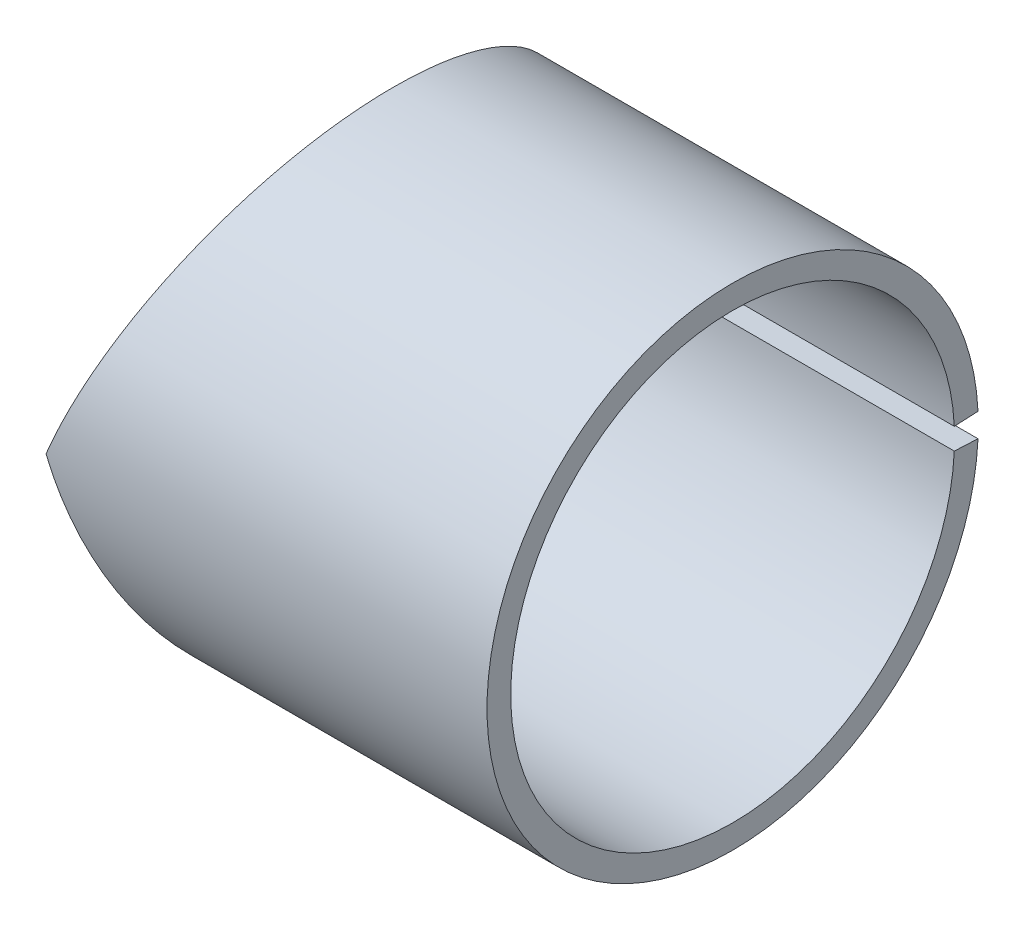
ISO-10303-21;
HEADER;
FILE_DESCRIPTION(('STEP AP214'),'2;1');
FILE_NAME('part.step','',(''),(''),'','','');
FILE_SCHEMA(('AUTOMOTIVE_DESIGN { 1 0 10303 214 1 1 1 1 }'));
ENDSEC;
DATA;
#1=APPLICATION_CONTEXT('core data for automotive mechanical design processes');
#2=APPLICATION_PROTOCOL_DEFINITION('international standard','automotive_design',2000,#1);
#3=PRODUCT_CONTEXT('',#1,'mechanical');
#4=PRODUCT('Part','Part','',(#3));
#5=PRODUCT_RELATED_PRODUCT_CATEGORY('part','',(#4));
#6=PRODUCT_DEFINITION_FORMATION('','',#4);
#7=PRODUCT_DEFINITION_CONTEXT('part definition',#1,'design');
#8=PRODUCT_DEFINITION('design','',#6,#7);
#9=PRODUCT_DEFINITION_SHAPE('','',#8);
#10=(LENGTH_UNIT() NAMED_UNIT(*) SI_UNIT(.MILLI.,.METRE.));
#11=(NAMED_UNIT(*) PLANE_ANGLE_UNIT() SI_UNIT($,.RADIAN.));
#12=(NAMED_UNIT(*) SI_UNIT($,.STERADIAN.) SOLID_ANGLE_UNIT());
#13=UNCERTAINTY_MEASURE_WITH_UNIT(LENGTH_MEASURE(1.E-05),#10,'distance_accuracy_value','');
#14=(GEOMETRIC_REPRESENTATION_CONTEXT(3) GLOBAL_UNCERTAINTY_ASSIGNED_CONTEXT((#13)) GLOBAL_UNIT_ASSIGNED_CONTEXT((#10,
#11,#12)) REPRESENTATION_CONTEXT('',''));
#15=CARTESIAN_POINT('',(0.,0.,0.));
#16=DIRECTION('',(0.,0.,1.));
#17=DIRECTION('',(1.,0.,0.));
#18=AXIS2_PLACEMENT_3D('',#15,#16,#17);
#19=CARTESIAN_POINT('',(36.3119482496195,-1.32489505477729E-13,0.));
#20=DIRECTION('',(-1.,0.,0.));
#21=DIRECTION('',(0.,-1.,0.));
#22=AXIS2_PLACEMENT_3D('',#19,#20,#21);
#23=PLANE('',#22);
#24=DIRECTION('',(0.,-0.0483027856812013,-0.998832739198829));
#25=VECTOR('',#24,1.);
#26=CARTESIAN_POINT('',(36.3119482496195,-0.451697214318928,-9.34045437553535));
#27=LINE('',#26,#25);
#28=CARTESIAN_POINT('',(36.3119482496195,-0.451697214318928,-9.34045437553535));
#29=VERTEX_POINT('',#28);
#30=CARTESIAN_POINT('',(36.3119482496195,-0.500000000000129,-10.3392871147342));
#31=VERTEX_POINT('',#30);
#32=EDGE_CURVE('E13',#29,#31,#27,.T.);
#33=ORIENTED_EDGE('',*,*,#32,.F.);
#34=CARTESIAN_POINT('',(36.3119482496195,-1.32489505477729E-13,0.));
#35=DIRECTION('',(1.,0.,0.));
#36=DIRECTION('',(0.,1.,0.));
#37=AXIS2_PLACEMENT_3D('',#34,#35,#36);
#38=CIRCLE('',#37,9.3513698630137);
#39=CARTESIAN_POINT('',(36.3119482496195,0.451697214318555,-9.34045437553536));
#40=VERTEX_POINT('',#39);
#41=EDGE_CURVE('E85',#40,#29,#38,.T.);
#42=ORIENTED_EDGE('',*,*,#41,.F.);
#43=DIRECTION('',(0.,0.0483027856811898,-0.99883273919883));
#44=VECTOR('',#43,1.);
#45=CARTESIAN_POINT('',(36.3119482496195,0.451697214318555,-9.34045437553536));
#46=LINE('',#45,#44);
#47=CARTESIAN_POINT('',(36.3119482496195,0.499999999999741,-10.3392871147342));
#48=VERTEX_POINT('',#47);
#49=EDGE_CURVE('E50',#40,#48,#46,.T.);
#50=ORIENTED_EDGE('',*,*,#49,.T.);
#51=CARTESIAN_POINT('',(36.3119482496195,-1.32489505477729E-13,0.));
#52=DIRECTION('',(1.,0.,0.));
#53=DIRECTION('',(0.,1.,0.));
#54=AXIS2_PLACEMENT_3D('',#51,#52,#53);
#55=CIRCLE('',#54,10.3513698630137);
#56=EDGE_CURVE('E87',#48,#31,#55,.T.);
#57=ORIENTED_EDGE('',*,*,#56,.T.);
#58=EDGE_LOOP('',(#33,#42,#50,#57));
#59=FACE_BOUND('',#58,.T.);
#60=ADVANCED_FACE('F38',(#59),#23,.F.);
#61=CARTESIAN_POINT('',(27.1236668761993,0.451697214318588,-9.34045437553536));
#62=DIRECTION('',(0.,0.99883273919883,0.0483027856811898));
#63=DIRECTION('',(1.,0.,0.));
#64=AXIS2_PLACEMENT_3D('',#61,#62,#63);
#65=PLANE('',#64);
#66=ORIENTED_EDGE('',*,*,#49,.F.);
#67=DIRECTION('',(1.,0.,0.));
#68=VECTOR('',#67,1.);
#69=CARTESIAN_POINT('',(17.9353855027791,0.451697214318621,-9.34045437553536));
#70=LINE('',#69,#68);
#71=CARTESIAN_POINT('',(17.9353855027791,0.451697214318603,-9.34045437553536));
#72=VERTEX_POINT('',#71);
#73=EDGE_CURVE('E95',#72,#40,#70,.T.);
#74=ORIENTED_EDGE('',*,*,#73,.F.);
#75=CARTESIAN_POINT('',(17.9353855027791,0.499999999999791,-10.3392871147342));
#76=CARTESIAN_POINT('',(17.9353855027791,0.451697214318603,-9.34045437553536));
#77=B_SPLINE_CURVE_WITH_KNOTS('',1,(#75,#76),.UNSPECIFIED.,.F.,.F.,(2,2),(0.,1.),.UNSPECIFIED.);
#78=CARTESIAN_POINT('',(17.9353855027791,0.499999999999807,-10.3392871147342));
#79=VERTEX_POINT('',#78);
#80=EDGE_CURVE('E225',#72,#79,#77,.F.);
#81=ORIENTED_EDGE('',*,*,#80,.T.);
#82=DIRECTION('',(1.,0.,0.));
#83=VECTOR('',#82,1.);
#84=CARTESIAN_POINT('',(-42.9287737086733,0.500000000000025,-10.3392871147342));
#85=LINE('',#84,#83);
#86=EDGE_CURVE('E156',#79,#48,#85,.T.);
#87=ORIENTED_EDGE('',*,*,#86,.T.);
#88=EDGE_LOOP('',(#66,#74,#81,#87));
#89=FACE_BOUND('',#88,.T.);
#90=ADVANCED_FACE('F191',(#89),#65,.F.);
#91=CARTESIAN_POINT('',(17.7282787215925,0.,10.3513698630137));
#92=CARTESIAN_POINT('',(17.9038980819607,0.42399313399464,10.3513698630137));
#93=CARTESIAN_POINT('',(18.0572616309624,0.794849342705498,10.3257242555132));
#94=CARTESIAN_POINT('',(18.2540938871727,1.26999247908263,10.2744028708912));
#95=CARTESIAN_POINT('',(18.3141596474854,1.41488352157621,10.2550790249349));
#96=CARTESIAN_POINT('',(18.3959408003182,1.61211222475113,10.2252810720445));
#97=CARTESIAN_POINT('',(18.4218149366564,1.67450550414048,10.2152081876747));
#98=CARTESIAN_POINT('',(18.4585467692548,1.76309825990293,10.2001588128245));
#99=CARTESIAN_POINT('',(18.4704441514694,1.79179637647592,10.1951520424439));
#100=CARTESIAN_POINT('',(18.487770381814,1.83359817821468,10.1876874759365));
#101=CARTESIAN_POINT('',(18.4934591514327,1.84732455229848,10.185206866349));
#102=CARTESIAN_POINT('',(18.5018623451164,1.8676032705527,10.1815010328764));
#103=CARTESIAN_POINT('',(18.5046417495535,1.87431103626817,10.180268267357));
#104=CARTESIAN_POINT('',(18.5087783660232,1.88429503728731,10.1784233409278));
#105=CARTESIAN_POINT('',(18.5101518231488,1.8876100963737,10.1778090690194));
#106=CARTESIAN_POINT('',(18.5122038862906,1.89256328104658,10.1768887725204));
#107=CARTESIAN_POINT('',(18.5128865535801,1.89421110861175,10.1765821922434));
#108=CARTESIAN_POINT('',(18.5139085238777,1.896677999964,10.1761226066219));
#109=CARTESIAN_POINT('',(18.5142488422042,1.89749948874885,10.1759694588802));
#110=CARTESIAN_POINT('',(18.5149288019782,1.89914084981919,10.175663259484));
#111=CARTESIAN_POINT('',(18.5150464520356,1.89942484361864,10.1756103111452));
#112=CARTESIAN_POINT('',(18.6592991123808,2.24764509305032,10.1105619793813));
#113=CARTESIAN_POINT('',(18.7948836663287,2.57520301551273,10.0310461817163));
#114=CARTESIAN_POINT('',(18.986100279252,3.03688547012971,9.89716422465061));
#115=CARTESIAN_POINT('',(19.0478124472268,3.1858505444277,9.85009438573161));
#116=CARTESIAN_POINT('',(19.1373406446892,3.40192320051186,9.77668465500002));
#117=CARTESIAN_POINT('',(19.1666767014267,3.47271891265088,9.75174670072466));
#118=CARTESIAN_POINT('',(19.2099207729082,3.57707749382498,9.71374002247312));
#119=CARTESIAN_POINT('',(19.2242087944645,3.61155789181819,9.70097113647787));
#120=CARTESIAN_POINT('',(19.2454508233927,3.66282107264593,9.6816802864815));
#121=CARTESIAN_POINT('',(19.2524998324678,3.6798325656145,9.67522708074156));
#122=CARTESIAN_POINT('',(19.2630258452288,3.70523563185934,9.66551442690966));
#123=CARTESIAN_POINT('',(19.2665265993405,3.71368429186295,9.662271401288));
#124=CARTESIAN_POINT('',(19.2717658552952,3.72632876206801,9.65739884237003));
#125=CARTESIAN_POINT('',(19.2735102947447,3.73053883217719,9.65577331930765));
#126=CARTESIAN_POINT('',(19.2761239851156,3.73684681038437,9.65333305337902));
#127=CARTESIAN_POINT('',(19.2769947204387,3.73894828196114,9.65251930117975));
#128=CARTESIAN_POINT('',(19.2787352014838,3.74314884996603,9.65089114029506));
#129=CARTESIAN_POINT('',(19.279391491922,3.74473277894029,9.65027679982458));
#130=CARTESIAN_POINT('',(19.5576469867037,4.41629345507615,9.38947238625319));
#131=CARTESIAN_POINT('',(19.8101798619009,5.02755759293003,9.07199687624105));
#132=CARTESIAN_POINT('',(20.1520193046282,5.85288304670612,8.54407802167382));
#133=CARTESIAN_POINT('',(20.2598058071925,6.11284569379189,8.35944728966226));
#134=CARTESIAN_POINT('',(20.4122455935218,6.48034028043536,8.07342205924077));
#135=CARTESIAN_POINT('',(20.4615188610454,6.59910238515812,7.97656359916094));
#136=CARTESIAN_POINT('',(20.5331187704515,6.77171999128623,7.82945602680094));
#137=CARTESIAN_POINT('',(20.5566004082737,6.82833855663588,7.78011661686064));
#138=CARTESIAN_POINT('',(20.5912453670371,6.91189773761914,7.70570689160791));
#139=CARTESIAN_POINT('',(20.6026974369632,6.93952270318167,7.68083686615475));
#140=CARTESIAN_POINT('',(20.61973116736,6.98061968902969,7.64343835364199));
#141=CARTESIAN_POINT('',(20.6253850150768,6.99426194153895,7.63095660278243));
#142=CARTESIAN_POINT('',(20.633829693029,7.01464042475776,7.61221143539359));
#143=CARTESIAN_POINT('',(20.6366385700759,7.02141910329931,7.6059592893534));
#144=CARTESIAN_POINT('',(20.6408428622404,7.03156592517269,7.59657553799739));
#145=CARTESIAN_POINT('',(20.642242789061,7.03494466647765,7.59344669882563));
#146=CARTESIAN_POINT('',(20.6450396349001,7.04169508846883,7.58718719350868));
#147=CARTESIAN_POINT('',(20.6461545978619,7.04438620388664,7.58468928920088));
#148=CARTESIAN_POINT('',(20.862535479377,7.56667082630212,7.0990903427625));
#149=CARTESIAN_POINT('',(21.0513913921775,8.02361414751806,6.57492717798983));
#150=CARTESIAN_POINT('',(21.2959038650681,8.61396245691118,5.75020061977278));
#151=CARTESIAN_POINT('',(21.3709461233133,8.79496902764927,5.46885905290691));
#152=CARTESIAN_POINT('',(21.4738166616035,9.0429807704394,5.04010091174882));
#153=CARTESIAN_POINT('',(21.5064913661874,9.1217385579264,4.89605541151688));
#154=CARTESIAN_POINT('',(21.5530802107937,9.23405699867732,4.67864329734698));
#155=CARTESIAN_POINT('',(21.5682059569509,9.27052697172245,4.6059484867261));
#156=CARTESIAN_POINT('',(21.5902887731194,9.32378577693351,4.49661208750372));
#157=CARTESIAN_POINT('',(21.5975487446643,9.34129769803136,4.46011758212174));
#158=CARTESIAN_POINT('',(21.6082872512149,9.36720517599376,4.40530743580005));
#159=CARTESIAN_POINT('',(21.611841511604,9.3757809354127,4.38702598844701));
#160=CARTESIAN_POINT('',(21.6171350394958,9.38855462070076,4.35958736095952));
#161=CARTESIAN_POINT('',(21.6188932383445,9.39279752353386,4.35043840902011));
#162=CARTESIAN_POINT('',(21.6223970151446,9.40125336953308,4.33213512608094));
#163=CARTESIAN_POINT('',(21.6239759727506,9.40506415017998,4.32385802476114));
#164=CARTESIAN_POINT('',(21.7478586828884,9.70407314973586,3.67163521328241));
#165=CARTESIAN_POINT('',(21.8412271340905,9.93024305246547,3.00419650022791));
#166=CARTESIAN_POINT('',(21.9383672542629,10.164774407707,1.98726840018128));
#167=CARTESIAN_POINT('',(21.9635952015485,10.2255475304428,1.64565990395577));
#168=CARTESIAN_POINT('',(21.9907089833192,10.290736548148,1.1319847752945));
#169=CARTESIAN_POINT('',(21.9979588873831,10.3081406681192,0.96054858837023));
#170=CARTESIAN_POINT('',(22.0061517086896,10.3278007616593,0.703405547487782));
#171=CARTESIAN_POINT('',(22.0084356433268,10.3332799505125,0.617693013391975));
#172=CARTESIAN_POINT('',(22.0111910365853,10.3398942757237,0.489167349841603));
#173=CARTESIAN_POINT('',(22.0119977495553,10.3418316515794,0.446332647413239));
#174=CARTESIAN_POINT('',(22.0133876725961,10.3451728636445,0.36068429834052));
#175=CARTESIAN_POINT('',(22.0139605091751,10.3465516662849,0.318812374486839));
#176=CARTESIAN_POINT('',(22.0154060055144,10.3500399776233,0.187587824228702));
#177=CARTESIAN_POINT('',(22.0159100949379,10.3512565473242,0.100056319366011));
#178=CARTESIAN_POINT('',(22.0159768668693,10.3514151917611,-0.0312714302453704));
#179=CARTESIAN_POINT('',(22.0158858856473,10.3511971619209,-0.0736393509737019));
#180=CARTESIAN_POINT('',(22.0154801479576,10.3502287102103,-0.159596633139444));
#181=CARTESIAN_POINT('',(22.0151649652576,10.3494765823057,-0.202591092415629));
#182=CARTESIAN_POINT('',(22.013027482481,10.3443732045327,-0.417625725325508));
#183=CARTESIAN_POINT('',(22.0095204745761,10.3359928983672,-0.58985322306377));
#184=CARTESIAN_POINT('',(21.9936083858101,10.297855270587,-1.10648397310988));
#185=CARTESIAN_POINT('',(21.9758122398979,10.2550898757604,-1.45083856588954));
#186=CARTESIAN_POINT('',(21.9008595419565,10.0743399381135,-2.47836726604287));
#187=CARTESIAN_POINT('',(21.8221387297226,9.88370585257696,-3.15602521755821));
#188=CARTESIAN_POINT('',(21.7079484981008,9.60781031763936,-3.85263305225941));
#189=CARTESIAN_POINT('',(21.7011191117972,9.59131252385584,-3.89352384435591));
#190=CARTESIAN_POINT('',(21.690706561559,9.56616388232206,-3.95472541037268));
#191=CARTESIAN_POINT('',(21.6872076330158,9.55771401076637,-3.97510349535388));
#192=CARTESIAN_POINT('',(21.6801536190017,9.5406804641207,-4.01581388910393));
#193=CARTESIAN_POINT('',(21.6770536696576,9.53319596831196,-4.03353992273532));
#194=CARTESIAN_POINT('',(21.6606032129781,9.49348398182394,-4.12688818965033));
#195=CARTESIAN_POINT('',(21.6470330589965,9.46074322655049,-4.2014115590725));
#196=CARTESIAN_POINT('',(21.6050932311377,9.3595886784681,-4.42443347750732));
#197=CARTESIAN_POINT('',(21.5754941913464,9.28824183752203,-4.57238436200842));
#198=CARTESIAN_POINT('',(21.4817796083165,9.06234627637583,-5.01336679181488));
#199=CARTESIAN_POINT('',(21.4127466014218,8.89592882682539,-5.30353563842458));
#200=CARTESIAN_POINT('',(21.1859777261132,8.34869014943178,-6.15686271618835));
#201=CARTESIAN_POINT('',(21.0085720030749,7.91961893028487,-6.70292412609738));
#202=CARTESIAN_POINT('',(20.7922127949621,7.39702490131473,-7.24132782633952));
#203=CARTESIAN_POINT('',(20.7793833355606,7.36604019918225,-7.27284458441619));
#204=CARTESIAN_POINT('',(20.7632184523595,7.32700562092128,-7.31204274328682));
#205=CARTESIAN_POINT('',(20.7607154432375,7.32096172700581,-7.31809156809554));
#206=CARTESIAN_POINT('',(20.755255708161,7.3077792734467,-7.33125547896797));
#207=CARTESIAN_POINT('',(20.7525198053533,7.30117389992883,-7.33783379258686));
#208=CARTESIAN_POINT('',(20.7442939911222,7.2813152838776,-7.35755760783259));
#209=CARTESIAN_POINT('',(20.7387859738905,7.2680195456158,-7.37069198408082));
#210=CARTESIAN_POINT('',(20.7111251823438,7.20125682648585,-7.43628701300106));
#211=CARTESIAN_POINT('',(20.688610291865,7.14693768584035,-7.48851718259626));
#212=CARTESIAN_POINT('',(20.6199068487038,6.98122739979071,-7.64436533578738));
#213=CARTESIAN_POINT('',(20.5725595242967,6.86708230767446,-7.74714188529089));
#214=CARTESIAN_POINT('',(20.4258824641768,6.51346161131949,-8.05123288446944));
#215=CARTESIAN_POINT('',(20.3219176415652,6.26278009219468,-8.24832237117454));
#216=CARTESIAN_POINT('',(19.9914828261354,5.46524016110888,-8.81518698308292));
#217=CARTESIAN_POINT('',(19.7464724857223,4.87245337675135,-9.1607185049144));
#218=CARTESIAN_POINT('',(19.4683125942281,4.20086342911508,-9.46066072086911));
#219=CARTESIAN_POINT('',(19.4598593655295,4.18045569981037,-9.46969627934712));
#220=CARTESIAN_POINT('',(19.4492626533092,4.15487563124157,-9.48092283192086));
#221=CARTESIAN_POINT('',(19.4476820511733,4.1510601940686,-9.48259344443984));
#222=CARTESIAN_POINT('',(19.4441927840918,4.14263739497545,-9.48627611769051));
#223=CARTESIAN_POINT('',(19.4424463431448,4.13842165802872,-9.4881160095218));
#224=CARTESIAN_POINT('',(19.4372015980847,4.12576142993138,-9.49363130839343));
#225=CARTESIAN_POINT('',(19.4336978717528,4.117303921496,-9.49730233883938));
#226=CARTESIAN_POINT('',(19.4161430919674,4.07492953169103,-9.51562774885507));
#227=CARTESIAN_POINT('',(19.4019835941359,4.04075209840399,-9.53019291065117));
#228=CARTESIAN_POINT('',(19.3591580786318,3.93738372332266,-9.57358099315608));
#229=CARTESIAN_POINT('',(19.3301450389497,3.8673565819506,-9.60209662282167));
#230=CARTESIAN_POINT('',(19.2417178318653,3.65391631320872,-9.68623494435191));
#231=CARTESIAN_POINT('',(19.180915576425,3.50714209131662,-9.74045079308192));
#232=CARTESIAN_POINT('',(18.9929564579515,3.05333965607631,-9.89597150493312));
#233=CARTESIAN_POINT('',(18.8602472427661,2.7327869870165,-9.990173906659));
#234=CARTESIAN_POINT('',(18.7157563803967,2.38402523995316,-10.0731027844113));
#235=CARTESIAN_POINT('',(18.7113706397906,2.37343953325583,-10.0756022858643));
#236=CARTESIAN_POINT('',(18.7047811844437,2.35753525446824,-10.0793310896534));
#237=CARTESIAN_POINT('',(18.7036567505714,2.35482140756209,-10.0799647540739));
#238=CARTESIAN_POINT('',(18.7005037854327,2.34721178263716,-10.0817394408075));
#239=CARTESIAN_POINT('',(18.6989235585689,2.34339802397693,-10.0826265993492));
#240=CARTESIAN_POINT('',(18.6910037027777,2.3242844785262,-10.0870613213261));
#241=CARTESIAN_POINT('',(18.6846079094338,2.30885043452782,-10.0906056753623));
#242=CARTESIAN_POINT('',(18.6652408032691,2.26211788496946,-10.1012227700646));
#243=CARTESIAN_POINT('',(18.6520897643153,2.23038895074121,-10.1082795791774));
#244=CARTESIAN_POINT('',(18.6119177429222,2.1334744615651,-10.1293393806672));
#245=CARTESIAN_POINT('',(18.584177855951,2.06656100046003,-10.1432323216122));
#246=CARTESIAN_POINT('',(18.4980825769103,1.85886840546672,-10.1840747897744));
#247=CARTESIAN_POINT('',(18.4368515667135,1.71113209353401,-10.2101971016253));
#248=CARTESIAN_POINT('',(18.2416560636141,1.23992228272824,-10.2817513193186));
#249=CARTESIAN_POINT('',(18.0962127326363,0.888372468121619,-10.320505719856));
#250=CARTESIAN_POINT('',(17.9353855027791,0.499999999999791,-10.3392871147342));
#251=CARTESIAN_POINT('',(17.7282787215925,0.,9.3513698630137));
#252=CARTESIAN_POINT('',(17.9038968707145,0.383030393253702,9.3513698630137));
#253=CARTESIAN_POINT('',(18.0572616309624,0.718062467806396,9.32820176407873));
#254=CARTESIAN_POINT('',(18.2540938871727,1.14730413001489,9.28183831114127));
#255=CARTESIAN_POINT('',(18.3141596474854,1.27819789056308,9.26438125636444));
#256=CARTESIAN_POINT('',(18.3959408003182,1.45637320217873,9.23746195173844));
#257=CARTESIAN_POINT('',(18.4218149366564,1.51273894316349,9.22836216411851));
#258=CARTESIAN_POINT('',(18.4585467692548,1.59277314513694,9.21476664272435));
#259=CARTESIAN_POINT('',(18.4704441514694,1.61869886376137,9.21024355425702));
#260=CARTESIAN_POINT('',(18.487770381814,1.65646237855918,9.20350010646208));
#261=CARTESIAN_POINT('',(18.4934591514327,1.66886270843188,9.20125913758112));
#262=CARTESIAN_POINT('',(18.5018623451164,1.68718238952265,9.19791130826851));
#263=CARTESIAN_POINT('',(18.5046417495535,1.69324214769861,9.19679763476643));
#264=CARTESIAN_POINT('',(18.5087783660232,1.70226163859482,9.19513093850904));
#265=CARTESIAN_POINT('',(18.5101518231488,1.70525644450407,9.19457600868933));
#266=CARTESIAN_POINT('',(18.5122038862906,1.70973112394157,9.19374461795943));
#267=CARTESIAN_POINT('',(18.5128865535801,1.71121976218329,9.19346765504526));
#268=CARTESIAN_POINT('',(18.5139085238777,1.71344833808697,9.19305246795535));
#269=CARTESIAN_POINT('',(18.5142488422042,1.7141904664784,9.19291411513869));
#270=CARTESIAN_POINT('',(18.5149288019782,1.71567326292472,9.19263749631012));
#271=CARTESIAN_POINT('',(18.5150464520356,1.71592982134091,9.19258966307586));
#272=CARTESIAN_POINT('',(18.6592991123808,2.03051005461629,9.13382536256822));
#273=CARTESIAN_POINT('',(18.7948836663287,2.32642405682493,9.06199123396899));
#274=CARTESIAN_POINT('',(18.986100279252,2.74350541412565,8.9410430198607));
#275=CARTESIAN_POINT('',(19.0478124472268,2.87807963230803,8.89852038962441));
#276=CARTESIAN_POINT('',(19.1373406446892,3.07327846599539,8.83220244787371));
#277=CARTESIAN_POINT('',(19.1666767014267,3.13723491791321,8.80967363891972));
#278=CARTESIAN_POINT('',(19.2099207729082,3.23151187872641,8.77533861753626));
#279=CARTESIAN_POINT('',(19.2242087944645,3.26266127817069,8.76380327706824));
#280=CARTESIAN_POINT('',(19.2454508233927,3.30897215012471,8.74637603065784));
#281=CARTESIAN_POINT('',(19.2524998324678,3.32434023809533,8.74054624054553));
#282=CARTESIAN_POINT('',(19.2630258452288,3.34728922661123,8.7317718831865));
#283=CARTESIAN_POINT('',(19.2665265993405,3.35492169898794,8.72884215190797));
#284=CARTESIAN_POINT('',(19.2717658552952,3.36634464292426,8.72444030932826));
#285=CARTESIAN_POINT('',(19.2735102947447,3.37014799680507,8.72297182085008));
#286=CARTESIAN_POINT('',(19.2761239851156,3.37584658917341,8.72076729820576));
#287=CARTESIAN_POINT('',(19.2769947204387,3.3777450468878,8.72003215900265));
#288=CARTESIAN_POINT('',(19.2787352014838,3.38153981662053,8.7185612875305));
#289=CARTESIAN_POINT('',(19.279391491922,3.38297072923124,8.71800629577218));
#290=CARTESIAN_POINT('',(19.5576469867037,3.98965490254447,8.48239704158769));
#291=CARTESIAN_POINT('',(19.8101798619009,4.54186751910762,8.19559143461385));
#292=CARTESIAN_POINT('',(20.1520193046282,5.28746193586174,7.71867248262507));
#293=CARTESIAN_POINT('',(20.2598058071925,5.52231074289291,7.55187810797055));
#294=CARTESIAN_POINT('',(20.4122455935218,5.8543033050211,7.29348450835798));
#295=CARTESIAN_POINT('',(20.4615188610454,5.96159232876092,7.20598311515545));
#296=CARTESIAN_POINT('',(20.5331187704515,6.11753411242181,7.07308695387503));
#297=CARTESIAN_POINT('',(20.5566004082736,6.16868300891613,7.02851400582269));
#298=CARTESIAN_POINT('',(20.591245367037,6.24416990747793,6.96129267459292));
#299=CARTESIAN_POINT('',(20.6026974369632,6.26912614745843,6.93882523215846));
#300=CARTESIAN_POINT('',(20.61973116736,6.30625293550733,6.9050396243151));
#301=CARTESIAN_POINT('',(20.6253850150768,6.31857727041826,6.89376368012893));
#302=CARTESIAN_POINT('',(20.633829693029,6.33698707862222,6.87682940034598));
#303=CARTESIAN_POINT('',(20.6366385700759,6.34311089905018,6.87118124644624));
#304=CARTESIAN_POINT('',(20.6408428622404,6.35227748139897,6.86270401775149));
#305=CARTESIAN_POINT('',(20.642242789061,6.35532981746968,6.85987744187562));
#306=CARTESIAN_POINT('',(20.6450396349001,6.36142811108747,6.85422263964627));
#307=CARTESIAN_POINT('',(20.6461545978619,6.36385924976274,6.85196604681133));
#308=CARTESIAN_POINT('',(20.862535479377,6.83568826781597,6.41327866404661));
#309=CARTESIAN_POINT('',(21.0513913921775,7.24848831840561,5.93975258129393));
#310=CARTESIAN_POINT('',(21.2959038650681,7.78180569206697,5.19469920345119));
#311=CARTESIAN_POINT('',(21.3709461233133,7.94532601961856,4.94053679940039));
#312=CARTESIAN_POINT('',(21.4738166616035,8.16937844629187,4.55319908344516));
#313=CARTESIAN_POINT('',(21.5064913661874,8.24052779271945,4.42306918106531));
#314=CARTESIAN_POINT('',(21.5530802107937,8.34199564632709,4.2266602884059));
#315=CARTESIAN_POINT('',(21.5682059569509,8.37494241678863,4.16098820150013));
#316=CARTESIAN_POINT('',(21.5902887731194,8.42305612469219,4.06221430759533));
#317=CARTESIAN_POINT('',(21.5975487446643,8.43887629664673,4.02924537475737));
#318=CARTESIAN_POINT('',(21.6082872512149,8.46228096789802,3.97973019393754));
#319=CARTESIAN_POINT('',(21.611841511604,8.47002826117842,3.96321483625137));
#320=CARTESIAN_POINT('',(21.6171350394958,8.48156793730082,3.93842693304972));
#321=CARTESIAN_POINT('',(21.6188932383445,8.4854009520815,3.93016182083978));
#322=CARTESIAN_POINT('',(21.6223970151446,8.49303991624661,3.91362673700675));
#323=CARTESIAN_POINT('',(21.6239759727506,8.49648255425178,3.90614924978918));
#324=CARTESIAN_POINT('',(21.7478586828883,8.76660561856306,3.31693479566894));
#325=CARTESIAN_POINT('',(21.8412271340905,8.9709262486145,2.71397438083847));
#326=CARTESIAN_POINT('',(21.9383672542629,9.18280056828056,1.79528720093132));
#327=CARTESIAN_POINT('',(21.9635952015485,9.23770266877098,1.48667998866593));
#328=CARTESIAN_POINT('',(21.9907089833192,9.29659406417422,1.02262873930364));
#329=CARTESIAN_POINT('',(21.9979588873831,9.31231684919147,0.867754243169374));
#330=CARTESIAN_POINT('',(22.0061517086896,9.33007766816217,0.635452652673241));
#331=CARTESIAN_POINT('',(22.0084356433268,9.33502753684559,0.558020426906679));
#332=CARTESIAN_POINT('',(22.0111910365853,9.34100288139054,0.441911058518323));
#333=CARTESIAN_POINT('',(22.0119977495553,9.34275309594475,0.40321442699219));
#334=CARTESIAN_POINT('',(22.0133876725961,9.34577152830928,0.325840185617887));
#335=CARTESIAN_POINT('',(22.0139605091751,9.34701713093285,0.288013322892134));
#336=CARTESIAN_POINT('',(22.0154060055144,9.35016845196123,0.169465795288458));
#337=CARTESIAN_POINT('',(22.0159100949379,9.35126749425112,0.0903903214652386));
#338=CARTESIAN_POINT('',(22.0159768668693,9.35141081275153,-0.0282504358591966));
#339=CARTESIAN_POINT('',(22.0158858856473,9.35121384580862,-0.0665253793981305));
#340=CARTESIAN_POINT('',(22.0154801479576,9.35033895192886,-0.144178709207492));
#341=CARTESIAN_POINT('',(22.0151649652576,9.34965948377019,-0.183019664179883));
#342=CARTESIAN_POINT('',(22.013027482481,9.3450491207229,-0.377280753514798));
#343=CARTESIAN_POINT('',(22.0095204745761,9.33747839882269,-0.532870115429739));
#344=CARTESIAN_POINT('',(21.9936083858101,9.30302507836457,-0.999591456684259));
#345=CARTESIAN_POINT('',(21.9758122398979,9.26439105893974,-1.31067947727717));
#346=CARTESIAN_POINT('',(21.9008595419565,9.10110257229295,-2.23894318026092));
#347=CARTESIAN_POINT('',(21.8221387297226,8.92888480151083,-2.85113559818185));
#348=CARTESIAN_POINT('',(21.7079484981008,8.67964231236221,-3.48044723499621));
#349=CARTESIAN_POINT('',(21.7011191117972,8.66473829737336,-3.51738774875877));
#350=CARTESIAN_POINT('',(21.690706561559,8.64201915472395,-3.57267690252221));
#351=CARTESIAN_POINT('',(21.6872076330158,8.63438558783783,-3.59108635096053));
#352=CARTESIAN_POINT('',(21.6801536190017,8.61899757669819,-3.62786389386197));
#353=CARTESIAN_POINT('',(21.6770536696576,8.61223612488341,-3.64387749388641));
#354=CARTESIAN_POINT('',(21.6606032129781,8.57636053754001,-3.7282077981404));
#355=CARTESIAN_POINT('',(21.6470330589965,8.54678272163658,-3.7955317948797));
#356=CARTESIAN_POINT('',(21.6050932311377,8.4554002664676,-3.99700855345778));
#357=CARTESIAN_POINT('',(21.5754941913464,8.39094592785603,-4.13066655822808));
#358=CARTESIAN_POINT('',(21.4817796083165,8.18687313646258,-4.52904762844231));
#359=CARTESIAN_POINT('',(21.4127466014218,8.03653253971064,-4.7911845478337));
#360=CARTESIAN_POINT('',(21.1859777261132,7.54216016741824,-5.5620754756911));
#361=CARTESIAN_POINT('',(21.0085720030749,7.15453961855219,-6.0553843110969));
#362=CARTESIAN_POINT('',(20.7922127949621,6.68243108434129,-6.54177521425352));
#363=CARTESIAN_POINT('',(20.7793833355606,6.65443967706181,-6.5702472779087));
#364=CARTESIAN_POINT('',(20.7632184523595,6.61917605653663,-6.60565867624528));
#365=CARTESIAN_POINT('',(20.7607154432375,6.61371603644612,-6.61112315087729));
#366=CARTESIAN_POINT('',(20.755255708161,6.60180708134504,-6.62301535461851));
#367=CARTESIAN_POINT('',(20.7525198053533,6.59583982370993,-6.62895816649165));
#368=CARTESIAN_POINT('',(20.7442939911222,6.57789966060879,-6.64677655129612));
#369=CARTESIAN_POINT('',(20.7387859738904,6.56588836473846,-6.6586420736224));
#370=CARTESIAN_POINT('',(20.7111251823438,6.50557529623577,-6.71790025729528));
#371=CARTESIAN_POINT('',(20.688610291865,6.45650368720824,-6.76508470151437));
#372=CARTESIAN_POINT('',(20.6199068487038,6.30680193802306,-6.90587705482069));
#373=CARTESIAN_POINT('',(20.5725595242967,6.20368389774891,-6.99872481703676));
#374=CARTESIAN_POINT('',(20.4258824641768,5.88422493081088,-7.2734389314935));
#375=CARTESIAN_POINT('',(20.3219176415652,5.65776064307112,-7.45148847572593));
#376=CARTESIAN_POINT('',(19.9914828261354,4.9372675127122,-7.96359080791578));
#377=CARTESIAN_POINT('',(19.7464724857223,4.40174723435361,-8.275742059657));
#378=CARTESIAN_POINT('',(19.4683125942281,3.79503661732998,-8.5467081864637));
#379=CARTESIAN_POINT('',(19.4598593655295,3.77660038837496,-8.55487085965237));
#380=CARTESIAN_POINT('',(19.4492626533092,3.75349149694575,-8.56501286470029));
#381=CARTESIAN_POINT('',(19.4476820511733,3.75004465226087,-8.56652208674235));
#382=CARTESIAN_POINT('',(19.4441927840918,3.74243554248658,-8.5698489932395));
#383=CARTESIAN_POINT('',(19.4424463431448,3.73862706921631,-8.57151114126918));
#384=CARTESIAN_POINT('',(19.4372015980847,3.72718988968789,-8.57649363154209));
#385=CARTESIAN_POINT('',(19.4336978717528,3.7195494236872,-8.57981001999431));
#386=CARTESIAN_POINT('',(19.4161430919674,3.68126863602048,-8.59636509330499));
#387=CARTESIAN_POINT('',(19.4019835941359,3.65039293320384,-8.60952317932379));
#388=CARTESIAN_POINT('',(19.3591580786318,3.55701051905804,-8.64871973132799));
#389=CARTESIAN_POINT('',(19.3301450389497,3.4937483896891,-8.67448059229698));
#390=CARTESIAN_POINT('',(19.2417178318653,3.30092764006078,-8.75049068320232));
#391=CARTESIAN_POINT('',(19.180915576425,3.16833262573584,-8.79946897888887));
#392=CARTESIAN_POINT('',(18.9929564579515,2.75837003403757,-8.939965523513));
#393=CARTESIAN_POINT('',(18.8602472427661,2.46878453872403,-9.02506744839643));
#394=CARTESIAN_POINT('',(18.7157563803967,2.15371511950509,-9.09998493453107));
#395=CARTESIAN_POINT('',(18.7113706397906,2.14415205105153,-9.10224297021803));
#396=CARTESIAN_POINT('',(18.7047811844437,2.12978421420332,-9.10561155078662));
#397=CARTESIAN_POINT('',(18.7036567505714,2.12733254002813,-9.10618399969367));
#398=CARTESIAN_POINT('',(18.7005037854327,2.12045804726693,-9.1077872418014));
#399=CARTESIAN_POINT('',(18.6989235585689,2.1170127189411,-9.10858869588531));
#400=CARTESIAN_POINT('',(18.6910037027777,2.0997456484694,-9.11259499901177));
#401=CARTESIAN_POINT('',(18.6846079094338,2.08580261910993,-9.11579694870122));
#402=CARTESIAN_POINT('',(18.6652408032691,2.04358469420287,-9.12538837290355));
#403=CARTESIAN_POINT('',(18.6520897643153,2.01492095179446,-9.13176345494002));
#404=CARTESIAN_POINT('',(18.6119177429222,1.9273689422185,-9.15078876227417));
#405=CARTESIAN_POINT('',(18.584177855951,1.86691969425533,-9.16333956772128));
#406=CARTESIAN_POINT('',(18.4980825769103,1.67929136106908,-9.20023642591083));
#407=CARTESIAN_POINT('',(18.4368515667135,1.5458271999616,-9.22383517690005));
#408=CARTESIAN_POINT('',(18.2416560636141,1.12013888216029,-9.28847685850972));
#409=CARTESIAN_POINT('',(18.0962119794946,0.802549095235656,-9.32348744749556));
#410=CARTESIAN_POINT('',(17.9353855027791,0.451697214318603,-9.34045437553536));
#411=B_SPLINE_SURFACE_WITH_KNOTS('',1,3,((#91,#92,#93,#94,#95,#96,#97,#98,#99,#100,#101,#102,
#103,#104,#105,#106,#107,#108,#109,#110,#111,#112,#113,#114,#115,#116,#117,#118,#119,#120,#121,
#122,#123,#124,#125,#126,#127,#128,#129,#130,#131,#132,#133,#134,#135,#136,#137,#138,#139,#140,
#141,#142,#143,#144,#145,#146,#147,#148,#149,#150,#151,#152,#153,#154,#155,#156,#157,#158,#159,
#160,#161,#162,#163,#164,#165,#166,#167,#168,#169,#170,#171,#172,#173,#174,#175,#176,#177,#178,
#179,#180,#181,#182,#183,#184,#185,#186,#187,#188,#189,#190,#191,#192,#193,#194,#195,#196,#197,
#198,#199,#200,#201,#202,#203,#204,#205,#206,#207,#208,#209,#210,#211,#212,#213,#214,#215,#216,
#217,#218,#219,#220,#221,#222,#223,#224,#225,#226,#227,#228,#229,#230,#231,#232,#233,#234,#235,
#236,#237,#238,#239,#240,#241,#242,#243,#244,#245,#246,#247,#248,#249,#250),(#251,#252,#253,
#254,#255,#256,#257,#258,#259,#260,#261,#262,#263,#264,#265,#266,#267,#268,#269,#270,#271,#272,
#273,#274,#275,#276,#277,#278,#279,#280,#281,#282,#283,#284,#285,#286,#287,#288,#289,#290,#291,
#292,#293,#294,#295,#296,#297,#298,#299,#300,#301,#302,#303,#304,#305,#306,#307,#308,#309,#310,
#311,#312,#313,#314,#315,#316,#317,#318,#319,#320,#321,#322,#323,#324,#325,#326,#327,#328,#329,
#330,#331,#332,#333,#334,#335,#336,#337,#338,#339,#340,#341,#342,#343,#344,#345,#346,#347,#348,
#349,#350,#351,#352,#353,#354,#355,#356,#357,#358,#359,#360,#361,#362,#363,#364,#365,#366,#367,
#368,#369,#370,#371,#372,#373,#374,#375,#376,#377,#378,#379,#380,#381,#382,#383,#384,#385,#386,
#387,#388,#389,#390,#391,#392,#393,#394,#395,#396,#397,#398,#399,#400,#401,#402,#403,#404,#405,
#406,#407,#408,#409,#410)),.UNSPECIFIED.,.F.,.F.,.F.,(2,2),(4,2,2,2,2,2,2,2,2,2,2,2,2,2,2,2,2,2,
2,2,2,2,2,2,2,2,2,2,2,2,2,2,2,2,2,2,2,2,2,2,2,2,2,2,2,2,2,2,2,2,2,2,2,2,2,2,2,2,2,2,2,2,2,2,2,2,
2,2,2,2,2,2,2,2,2,2,2,2,2,4),(0.,1.),(0.,0.03125,0.046875,0.0546875,0.05859375,0.060546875,
0.0615234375,0.06201171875,0.062255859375,0.0623779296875,0.0625,0.09375,0.109375,0.1171875,
0.12109375,0.123046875,0.1240234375,0.12451171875,0.124755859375,0.125,0.1875,0.21875,0.234375,
0.2421875,0.24609375,0.248046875,0.2490234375,0.24951171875,0.25,0.3125,0.34375,0.359375,
0.3671875,0.37109375,0.373046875,0.3740234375,0.375,0.4375,0.46875,0.484375,0.4921875,
0.49609375,0.5,0.5078125,0.51171875,0.515625,0.53125,0.5625,0.625,0.62890625,0.630859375,
0.6328125,0.640625,0.65625,0.6875,0.75,0.75390625,0.7548828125,0.755859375,0.7578125,0.765625,
0.78125,0.8125,0.875,0.876953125,0.87744140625,0.8779296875,0.87890625,0.8828125,0.890625,
0.90625,0.9375,0.9384765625,0.93896484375,0.939453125,0.94140625,0.9453125,0.953125,0.96875,1.),.UNSPECIFIED.);
#412=CARTESIAN_POINT('',(17.9353855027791,0.451697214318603,-9.34045437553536));
#413=CARTESIAN_POINT('',(18.0962119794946,0.802549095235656,-9.32348744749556));
#414=CARTESIAN_POINT('',(18.2416560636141,1.12013888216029,-9.28847685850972));
#415=CARTESIAN_POINT('',(18.4368515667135,1.5458271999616,-9.22383517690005));
#416=CARTESIAN_POINT('',(18.4980825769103,1.67929136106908,-9.20023642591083));
#417=CARTESIAN_POINT('',(18.584177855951,1.86691969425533,-9.16333956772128));
#418=CARTESIAN_POINT('',(18.6119177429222,1.9273689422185,-9.15078876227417));
#419=CARTESIAN_POINT('',(18.6520897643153,2.01492095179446,-9.13176345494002));
#420=CARTESIAN_POINT('',(18.6652408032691,2.04358469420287,-9.12538837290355));
#421=CARTESIAN_POINT('',(18.6846079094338,2.08580261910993,-9.11579694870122));
#422=CARTESIAN_POINT('',(18.6910037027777,2.0997456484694,-9.11259499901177));
#423=CARTESIAN_POINT('',(18.6989235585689,2.1170127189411,-9.10858869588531));
#424=CARTESIAN_POINT('',(18.7005037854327,2.12045804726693,-9.1077872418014));
#425=CARTESIAN_POINT('',(18.7036567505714,2.12733254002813,-9.10618399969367));
#426=CARTESIAN_POINT('',(18.7047811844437,2.12978421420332,-9.10561155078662));
#427=CARTESIAN_POINT('',(18.7113706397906,2.14415205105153,-9.10224297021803));
#428=CARTESIAN_POINT('',(18.7157563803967,2.15371511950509,-9.09998493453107));
#429=CARTESIAN_POINT('',(18.8602472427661,2.46878453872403,-9.02506744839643));
#430=CARTESIAN_POINT('',(18.9929564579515,2.75837003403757,-8.939965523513));
#431=CARTESIAN_POINT('',(19.180915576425,3.16833262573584,-8.79946897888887));
#432=CARTESIAN_POINT('',(19.2417178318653,3.30092764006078,-8.75049068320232));
#433=CARTESIAN_POINT('',(19.3301450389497,3.4937483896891,-8.67448059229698));
#434=CARTESIAN_POINT('',(19.3591580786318,3.55701051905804,-8.64871973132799));
#435=CARTESIAN_POINT('',(19.4019835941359,3.65039293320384,-8.60952317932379));
#436=CARTESIAN_POINT('',(19.4161430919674,3.68126863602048,-8.59636509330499));
#437=CARTESIAN_POINT('',(19.4336978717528,3.7195494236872,-8.57981001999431));
#438=CARTESIAN_POINT('',(19.4372015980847,3.72718988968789,-8.57649363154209));
#439=CARTESIAN_POINT('',(19.4424463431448,3.73862706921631,-8.57151114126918));
#440=CARTESIAN_POINT('',(19.4441927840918,3.74243554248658,-8.5698489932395));
#441=CARTESIAN_POINT('',(19.4476820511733,3.75004465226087,-8.56652208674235));
#442=CARTESIAN_POINT('',(19.4492626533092,3.75349149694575,-8.56501286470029));
#443=CARTESIAN_POINT('',(19.4598593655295,3.77660038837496,-8.55487085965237));
#444=CARTESIAN_POINT('',(19.4683125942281,3.79503661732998,-8.5467081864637));
#445=CARTESIAN_POINT('',(19.7464724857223,4.40174723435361,-8.275742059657));
#446=CARTESIAN_POINT('',(19.9914828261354,4.9372675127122,-7.96359080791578));
#447=CARTESIAN_POINT('',(20.3219176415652,5.65776064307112,-7.45148847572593));
#448=CARTESIAN_POINT('',(20.4258824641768,5.88422493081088,-7.2734389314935));
#449=CARTESIAN_POINT('',(20.5725595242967,6.20368389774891,-6.99872481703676));
#450=CARTESIAN_POINT('',(20.6199068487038,6.30680193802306,-6.90587705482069));
#451=CARTESIAN_POINT('',(20.688610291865,6.45650368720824,-6.76508470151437));
#452=CARTESIAN_POINT('',(20.7111251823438,6.50557529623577,-6.71790025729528));
#453=CARTESIAN_POINT('',(20.7387859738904,6.56588836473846,-6.6586420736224));
#454=CARTESIAN_POINT('',(20.7442939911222,6.57789966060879,-6.64677655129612));
#455=CARTESIAN_POINT('',(20.7525198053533,6.59583982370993,-6.62895816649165));
#456=CARTESIAN_POINT('',(20.755255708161,6.60180708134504,-6.62301535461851));
#457=CARTESIAN_POINT('',(20.7607154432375,6.61371603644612,-6.61112315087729));
#458=CARTESIAN_POINT('',(20.7632184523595,6.61917605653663,-6.60565867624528));
#459=CARTESIAN_POINT('',(20.7793833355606,6.65443967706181,-6.5702472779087));
#460=CARTESIAN_POINT('',(20.7922127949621,6.68243108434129,-6.54177521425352));
#461=CARTESIAN_POINT('',(21.0085720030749,7.15453961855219,-6.0553843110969));
#462=CARTESIAN_POINT('',(21.1859777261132,7.54216016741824,-5.5620754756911));
#463=CARTESIAN_POINT('',(21.4127466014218,8.03653253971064,-4.7911845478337));
#464=CARTESIAN_POINT('',(21.4817796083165,8.18687313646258,-4.52904762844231));
#465=CARTESIAN_POINT('',(21.5754941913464,8.39094592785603,-4.13066655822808));
#466=CARTESIAN_POINT('',(21.6050932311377,8.4554002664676,-3.99700855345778));
#467=CARTESIAN_POINT('',(21.6470330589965,8.54678272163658,-3.7955317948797));
#468=CARTESIAN_POINT('',(21.6606032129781,8.57636053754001,-3.7282077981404));
#469=CARTESIAN_POINT('',(21.6770536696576,8.61223612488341,-3.64387749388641));
#470=CARTESIAN_POINT('',(21.6801536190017,8.61899757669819,-3.62786389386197));
#471=CARTESIAN_POINT('',(21.6872076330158,8.63438558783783,-3.59108635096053));
#472=CARTESIAN_POINT('',(21.690706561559,8.64201915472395,-3.57267690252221));
#473=CARTESIAN_POINT('',(21.7011191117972,8.66473829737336,-3.51738774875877));
#474=CARTESIAN_POINT('',(21.7079484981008,8.67964231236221,-3.48044723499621));
#475=CARTESIAN_POINT('',(21.8221387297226,8.92888480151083,-2.85113559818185));
#476=CARTESIAN_POINT('',(21.9008595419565,9.10110257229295,-2.23894318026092));
#477=CARTESIAN_POINT('',(21.9758122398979,9.26439105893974,-1.31067947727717));
#478=CARTESIAN_POINT('',(21.9936083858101,9.30302507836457,-0.999591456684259));
#479=CARTESIAN_POINT('',(22.0095204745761,9.33747839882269,-0.532870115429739));
#480=CARTESIAN_POINT('',(22.013027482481,9.3450491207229,-0.377280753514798));
#481=CARTESIAN_POINT('',(22.0151649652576,9.34965948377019,-0.183019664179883));
#482=CARTESIAN_POINT('',(22.0154801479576,9.35033895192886,-0.144178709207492));
#483=CARTESIAN_POINT('',(22.0158858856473,9.35121384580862,-0.0665253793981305));
#484=CARTESIAN_POINT('',(22.0159768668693,9.35141081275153,-0.0282504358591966));
#485=CARTESIAN_POINT('',(22.0159100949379,9.35126749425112,0.0903903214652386));
#486=CARTESIAN_POINT('',(22.0154060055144,9.35016845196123,0.169465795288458));
#487=CARTESIAN_POINT('',(22.0139605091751,9.34701713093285,0.288013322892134));
#488=CARTESIAN_POINT('',(22.0133876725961,9.34577152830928,0.325840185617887));
#489=CARTESIAN_POINT('',(22.0119977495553,9.34275309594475,0.40321442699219));
#490=CARTESIAN_POINT('',(22.0111910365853,9.34100288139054,0.441911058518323));
#491=CARTESIAN_POINT('',(22.0084356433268,9.33502753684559,0.558020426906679));
#492=CARTESIAN_POINT('',(22.0061517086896,9.33007766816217,0.635452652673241));
#493=CARTESIAN_POINT('',(21.9979588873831,9.31231684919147,0.867754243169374));
#494=CARTESIAN_POINT('',(21.9907089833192,9.29659406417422,1.02262873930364));
#495=CARTESIAN_POINT('',(21.9635952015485,9.23770266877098,1.48667998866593));
#496=CARTESIAN_POINT('',(21.9383672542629,9.18280056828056,1.79528720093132));
#497=CARTESIAN_POINT('',(21.8412271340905,8.9709262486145,2.71397438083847));
#498=CARTESIAN_POINT('',(21.7478586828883,8.76660561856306,3.31693479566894));
#499=CARTESIAN_POINT('',(21.6239759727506,8.49648255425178,3.90614924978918));
#500=CARTESIAN_POINT('',(21.6223970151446,8.49303991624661,3.91362673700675));
#501=CARTESIAN_POINT('',(21.6188932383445,8.4854009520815,3.93016182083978));
#502=CARTESIAN_POINT('',(21.6171350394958,8.48156793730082,3.93842693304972));
#503=CARTESIAN_POINT('',(21.611841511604,8.47002826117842,3.96321483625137));
#504=CARTESIAN_POINT('',(21.6082872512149,8.46228096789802,3.97973019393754));
#505=CARTESIAN_POINT('',(21.5975487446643,8.43887629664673,4.02924537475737));
#506=CARTESIAN_POINT('',(21.5902887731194,8.42305612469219,4.06221430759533));
#507=CARTESIAN_POINT('',(21.5682059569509,8.37494241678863,4.16098820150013));
#508=CARTESIAN_POINT('',(21.5530802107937,8.34199564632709,4.2266602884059));
#509=CARTESIAN_POINT('',(21.5064913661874,8.24052779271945,4.42306918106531));
#510=CARTESIAN_POINT('',(21.4738166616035,8.16937844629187,4.55319908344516));
#511=CARTESIAN_POINT('',(21.3709461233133,7.94532601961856,4.94053679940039));
#512=CARTESIAN_POINT('',(21.2959038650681,7.78180569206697,5.19469920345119));
#513=CARTESIAN_POINT('',(21.0513913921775,7.24848831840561,5.93975258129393));
#514=CARTESIAN_POINT('',(20.862535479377,6.83568826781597,6.41327866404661));
#515=CARTESIAN_POINT('',(20.6461545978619,6.36385924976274,6.85196604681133));
#516=CARTESIAN_POINT('',(20.6450396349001,6.36142811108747,6.85422263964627));
#517=CARTESIAN_POINT('',(20.642242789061,6.35532981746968,6.85987744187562));
#518=CARTESIAN_POINT('',(20.6408428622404,6.35227748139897,6.86270401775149));
#519=CARTESIAN_POINT('',(20.6366385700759,6.34311089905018,6.87118124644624));
#520=CARTESIAN_POINT('',(20.633829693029,6.33698707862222,6.87682940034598));
#521=CARTESIAN_POINT('',(20.6253850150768,6.31857727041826,6.89376368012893));
#522=CARTESIAN_POINT('',(20.61973116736,6.30625293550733,6.9050396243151));
#523=CARTESIAN_POINT('',(20.6026974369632,6.26912614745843,6.93882523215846));
#524=CARTESIAN_POINT('',(20.591245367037,6.24416990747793,6.96129267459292));
#525=CARTESIAN_POINT('',(20.5566004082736,6.16868300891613,7.02851400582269));
#526=CARTESIAN_POINT('',(20.5331187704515,6.11753411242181,7.07308695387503));
#527=CARTESIAN_POINT('',(20.4615188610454,5.96159232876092,7.20598311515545));
#528=CARTESIAN_POINT('',(20.4122455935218,5.8543033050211,7.29348450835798));
#529=CARTESIAN_POINT('',(20.2598058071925,5.52231074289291,7.55187810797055));
#530=CARTESIAN_POINT('',(20.1520193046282,5.28746193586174,7.71867248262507));
#531=CARTESIAN_POINT('',(19.8101798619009,4.54186751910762,8.19559143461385));
#532=CARTESIAN_POINT('',(19.5576469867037,3.98965490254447,8.48239704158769));
#533=CARTESIAN_POINT('',(19.279391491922,3.38297072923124,8.71800629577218));
#534=CARTESIAN_POINT('',(19.2787352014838,3.38153981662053,8.7185612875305));
#535=CARTESIAN_POINT('',(19.2769947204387,3.3777450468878,8.72003215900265));
#536=CARTESIAN_POINT('',(19.2761239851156,3.37584658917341,8.72076729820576));
#537=CARTESIAN_POINT('',(19.2735102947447,3.37014799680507,8.72297182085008));
#538=CARTESIAN_POINT('',(19.2717658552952,3.36634464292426,8.72444030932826));
#539=CARTESIAN_POINT('',(19.2665265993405,3.35492169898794,8.72884215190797));
#540=CARTESIAN_POINT('',(19.2630258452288,3.34728922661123,8.7317718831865));
#541=CARTESIAN_POINT('',(19.2524998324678,3.32434023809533,8.74054624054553));
#542=CARTESIAN_POINT('',(19.2454508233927,3.30897215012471,8.74637603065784));
#543=CARTESIAN_POINT('',(19.2242087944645,3.26266127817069,8.76380327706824));
#544=CARTESIAN_POINT('',(19.2099207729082,3.23151187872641,8.77533861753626));
#545=CARTESIAN_POINT('',(19.1666767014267,3.13723491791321,8.80967363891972));
#546=CARTESIAN_POINT('',(19.1373406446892,3.07327846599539,8.83220244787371));
#547=CARTESIAN_POINT('',(19.0478124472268,2.87807963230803,8.89852038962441));
#548=CARTESIAN_POINT('',(18.986100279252,2.74350541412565,8.9410430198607));
#549=CARTESIAN_POINT('',(18.7948836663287,2.32642405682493,9.06199123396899));
#550=CARTESIAN_POINT('',(18.6592991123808,2.03051005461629,9.13382536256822));
#551=CARTESIAN_POINT('',(18.5150464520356,1.71592982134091,9.19258966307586));
#552=CARTESIAN_POINT('',(18.5149288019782,1.71567326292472,9.19263749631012));
#553=CARTESIAN_POINT('',(18.5142488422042,1.7141904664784,9.19291411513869));
#554=CARTESIAN_POINT('',(18.5139085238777,1.71344833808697,9.19305246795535));
#555=CARTESIAN_POINT('',(18.5128865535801,1.71121976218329,9.19346765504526));
#556=CARTESIAN_POINT('',(18.5122038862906,1.70973112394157,9.19374461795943));
#557=CARTESIAN_POINT('',(18.5101518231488,1.70525644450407,9.19457600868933));
#558=CARTESIAN_POINT('',(18.5087783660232,1.70226163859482,9.19513093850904));
#559=CARTESIAN_POINT('',(18.5046417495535,1.69324214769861,9.19679763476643));
#560=CARTESIAN_POINT('',(18.5018623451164,1.68718238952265,9.19791130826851));
#561=CARTESIAN_POINT('',(18.4934591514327,1.66886270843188,9.20125913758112));
#562=CARTESIAN_POINT('',(18.487770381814,1.65646237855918,9.20350010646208));
#563=CARTESIAN_POINT('',(18.4704441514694,1.61869886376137,9.21024355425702));
#564=CARTESIAN_POINT('',(18.4585467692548,1.59277314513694,9.21476664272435));
#565=CARTESIAN_POINT('',(18.4218149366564,1.51273894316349,9.22836216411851));
#566=CARTESIAN_POINT('',(18.3959408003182,1.45637320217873,9.23746195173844));
#567=CARTESIAN_POINT('',(18.3141596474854,1.27819789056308,9.26438125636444));
#568=CARTESIAN_POINT('',(18.2540938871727,1.14730413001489,9.28183831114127));
#569=CARTESIAN_POINT('',(18.0572616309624,0.718062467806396,9.32820176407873));
#570=CARTESIAN_POINT('',(17.9038968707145,0.383030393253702,9.3513698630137));
#571=CARTESIAN_POINT('',(17.7282787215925,0.,9.3513698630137));
#572=B_SPLINE_CURVE_WITH_KNOTS('',3,(#412,#413,#414,#415,#416,#417,#418,#419,#420,#421,#422,
#423,#424,#425,#426,#427,#428,#429,#430,#431,#432,#433,#434,#435,#436,#437,#438,#439,#440,#441,
#442,#443,#444,#445,#446,#447,#448,#449,#450,#451,#452,#453,#454,#455,#456,#457,#458,#459,#460,
#461,#462,#463,#464,#465,#466,#467,#468,#469,#470,#471,#472,#473,#474,#475,#476,#477,#478,#479,
#480,#481,#482,#483,#484,#485,#486,#487,#488,#489,#490,#491,#492,#493,#494,#495,#496,#497,#498,
#499,#500,#501,#502,#503,#504,#505,#506,#507,#508,#509,#510,#511,#512,#513,#514,#515,#516,#517,
#518,#519,#520,#521,#522,#523,#524,#525,#526,#527,#528,#529,#530,#531,#532,#533,#534,#535,#536,
#537,#538,#539,#540,#541,#542,#543,#544,#545,#546,#547,#548,#549,#550,#551,#552,#553,#554,#555,
#556,#557,#558,#559,#560,#561,#562,#563,#564,#565,#566,#567,#568,#569,#570,#571),.UNSPECIFIED.,
.F.,.F.,(4,2,2,2,2,2,2,2,2,2,2,2,2,2,2,2,2,2,2,2,2,2,2,2,2,2,2,2,2,2,2,2,2,2,2,2,2,2,2,2,2,2,2,
2,2,2,2,2,2,2,2,2,2,2,2,2,2,2,2,2,2,2,2,2,2,2,2,2,2,2,2,2,2,2,2,2,2,2,2,4),(0.,0.03125,0.046875,
0.0546875,0.05859375,0.060546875,0.06103515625,0.0615234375,0.0625,0.09375,0.109375,0.1171875,
0.12109375,0.1220703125,0.12255859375,0.123046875,0.125,0.1875,0.21875,0.234375,0.2421875,
0.244140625,0.2451171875,0.24609375,0.25,0.3125,0.34375,0.359375,0.3671875,0.369140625,
0.37109375,0.375,0.4375,0.46875,0.484375,0.48828125,0.4921875,0.5,0.50390625,0.5078125,0.515625,
0.53125,0.5625,0.625,0.6259765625,0.626953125,0.62890625,0.6328125,0.640625,0.65625,0.6875,0.75,
0.75048828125,0.7509765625,0.751953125,0.75390625,0.7578125,0.765625,0.78125,0.8125,0.875,
0.875244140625,0.87548828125,0.8759765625,0.876953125,0.87890625,0.8828125,0.890625,0.90625,
0.9375,0.9376220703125,0.937744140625,0.93798828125,0.9384765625,0.939453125,0.94140625,
0.9453125,0.953125,0.96875,1.),.UNSPECIFIED.);
#573=CARTESIAN_POINT('',(17.7282787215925,0.,9.3513698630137));
#574=VERTEX_POINT('',#573);
#575=EDGE_CURVE('E169',#574,#72,#572,.F.);
#576=CARTESIAN_POINT('',(17.7282787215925,0.,9.3513698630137));
#577=CARTESIAN_POINT('',(17.7282787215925,0.,10.3513698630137));
#578=B_SPLINE_CURVE_WITH_KNOTS('',1,(#576,#577),.UNSPECIFIED.,.F.,.F.,(2,2),(0.,1.),.UNSPECIFIED.);
#579=CARTESIAN_POINT('',(17.7282789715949,6.03573892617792E-07,10.3513698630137));
#580=VERTEX_POINT('',#579);
#581=EDGE_CURVE('E155',#574,#580,#578,.T.);
#582=CARTESIAN_POINT('',(17.7282787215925,0.,10.3513698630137));
#583=CARTESIAN_POINT('',(17.9038980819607,0.42399313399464,10.3513698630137));
#584=CARTESIAN_POINT('',(18.0572616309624,0.794849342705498,10.3257242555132));
#585=CARTESIAN_POINT('',(18.2540938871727,1.26999247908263,10.2744028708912));
#586=CARTESIAN_POINT('',(18.3141596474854,1.41488352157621,10.2550790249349));
#587=CARTESIAN_POINT('',(18.3959408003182,1.61211222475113,10.2252810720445));
#588=CARTESIAN_POINT('',(18.4218149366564,1.67450550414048,10.2152081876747));
#589=CARTESIAN_POINT('',(18.4585467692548,1.76309825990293,10.2001588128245));
#590=CARTESIAN_POINT('',(18.4704441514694,1.79179637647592,10.1951520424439));
#591=CARTESIAN_POINT('',(18.487770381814,1.83359817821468,10.1876874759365));
#592=CARTESIAN_POINT('',(18.4934591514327,1.84732455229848,10.185206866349));
#593=CARTESIAN_POINT('',(18.5018623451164,1.8676032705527,10.1815010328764));
#594=CARTESIAN_POINT('',(18.5046417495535,1.87431103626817,10.180268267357));
#595=CARTESIAN_POINT('',(18.5087783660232,1.88429503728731,10.1784233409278));
#596=CARTESIAN_POINT('',(18.5101518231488,1.8876100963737,10.1778090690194));
#597=CARTESIAN_POINT('',(18.5122038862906,1.89256328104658,10.1768887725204));
#598=CARTESIAN_POINT('',(18.5128865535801,1.89421110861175,10.1765821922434));
#599=CARTESIAN_POINT('',(18.5139085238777,1.896677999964,10.1761226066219));
#600=CARTESIAN_POINT('',(18.5142488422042,1.89749948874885,10.1759694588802));
#601=CARTESIAN_POINT('',(18.5149288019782,1.89914084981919,10.175663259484));
#602=CARTESIAN_POINT('',(18.5150464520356,1.89942484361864,10.1756103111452));
#603=CARTESIAN_POINT('',(18.6592991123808,2.24764509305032,10.1105619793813));
#604=CARTESIAN_POINT('',(18.7948836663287,2.57520301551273,10.0310461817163));
#605=CARTESIAN_POINT('',(18.986100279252,3.03688547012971,9.89716422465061));
#606=CARTESIAN_POINT('',(19.0478124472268,3.1858505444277,9.85009438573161));
#607=CARTESIAN_POINT('',(19.1373406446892,3.40192320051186,9.77668465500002));
#608=CARTESIAN_POINT('',(19.1666767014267,3.47271891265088,9.75174670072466));
#609=CARTESIAN_POINT('',(19.2099207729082,3.57707749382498,9.71374002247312));
#610=CARTESIAN_POINT('',(19.2242087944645,3.61155789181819,9.70097113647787));
#611=CARTESIAN_POINT('',(19.2454508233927,3.66282107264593,9.6816802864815));
#612=CARTESIAN_POINT('',(19.2524998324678,3.6798325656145,9.67522708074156));
#613=CARTESIAN_POINT('',(19.2630258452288,3.70523563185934,9.66551442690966));
#614=CARTESIAN_POINT('',(19.2665265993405,3.71368429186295,9.662271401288));
#615=CARTESIAN_POINT('',(19.2717658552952,3.72632876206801,9.65739884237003));
#616=CARTESIAN_POINT('',(19.2735102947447,3.73053883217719,9.65577331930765));
#617=CARTESIAN_POINT('',(19.2761239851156,3.73684681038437,9.65333305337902));
#618=CARTESIAN_POINT('',(19.2769947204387,3.73894828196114,9.65251930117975));
#619=CARTESIAN_POINT('',(19.2787352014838,3.74314884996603,9.65089114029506));
#620=CARTESIAN_POINT('',(19.279391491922,3.74473277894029,9.65027679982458));
#621=CARTESIAN_POINT('',(19.5576469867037,4.41629345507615,9.38947238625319));
#622=CARTESIAN_POINT('',(19.8101798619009,5.02755759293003,9.07199687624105));
#623=CARTESIAN_POINT('',(20.1520193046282,5.85288304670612,8.54407802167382));
#624=CARTESIAN_POINT('',(20.2598058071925,6.11284569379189,8.35944728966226));
#625=CARTESIAN_POINT('',(20.4122455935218,6.48034028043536,8.07342205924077));
#626=CARTESIAN_POINT('',(20.4615188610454,6.59910238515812,7.97656359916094));
#627=CARTESIAN_POINT('',(20.5331187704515,6.77171999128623,7.82945602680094));
#628=CARTESIAN_POINT('',(20.5566004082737,6.82833855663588,7.78011661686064));
#629=CARTESIAN_POINT('',(20.5912453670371,6.91189773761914,7.70570689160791));
#630=CARTESIAN_POINT('',(20.6026974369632,6.93952270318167,7.68083686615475));
#631=CARTESIAN_POINT('',(20.61973116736,6.98061968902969,7.64343835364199));
#632=CARTESIAN_POINT('',(20.6253850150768,6.99426194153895,7.63095660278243));
#633=CARTESIAN_POINT('',(20.633829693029,7.01464042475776,7.61221143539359));
#634=CARTESIAN_POINT('',(20.6366385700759,7.02141910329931,7.6059592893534));
#635=CARTESIAN_POINT('',(20.6408428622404,7.03156592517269,7.59657553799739));
#636=CARTESIAN_POINT('',(20.642242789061,7.03494466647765,7.59344669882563));
#637=CARTESIAN_POINT('',(20.6450396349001,7.04169508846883,7.58718719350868));
#638=CARTESIAN_POINT('',(20.6461545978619,7.04438620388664,7.58468928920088));
#639=CARTESIAN_POINT('',(20.862535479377,7.56667082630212,7.0990903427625));
#640=CARTESIAN_POINT('',(21.0513913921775,8.02361414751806,6.57492717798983));
#641=CARTESIAN_POINT('',(21.2959038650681,8.61396245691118,5.75020061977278));
#642=CARTESIAN_POINT('',(21.3709461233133,8.79496902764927,5.46885905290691));
#643=CARTESIAN_POINT('',(21.4738166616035,9.0429807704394,5.04010091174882));
#644=CARTESIAN_POINT('',(21.5064913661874,9.1217385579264,4.89605541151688));
#645=CARTESIAN_POINT('',(21.5530802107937,9.23405699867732,4.67864329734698));
#646=CARTESIAN_POINT('',(21.5682059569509,9.27052697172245,4.6059484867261));
#647=CARTESIAN_POINT('',(21.5902887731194,9.32378577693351,4.49661208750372));
#648=CARTESIAN_POINT('',(21.5975487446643,9.34129769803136,4.46011758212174));
#649=CARTESIAN_POINT('',(21.6082872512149,9.36720517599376,4.40530743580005));
#650=CARTESIAN_POINT('',(21.611841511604,9.3757809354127,4.38702598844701));
#651=CARTESIAN_POINT('',(21.6171350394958,9.38855462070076,4.35958736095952));
#652=CARTESIAN_POINT('',(21.6188932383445,9.39279752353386,4.35043840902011));
#653=CARTESIAN_POINT('',(21.6223970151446,9.40125336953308,4.33213512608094));
#654=CARTESIAN_POINT('',(21.6239759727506,9.40506415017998,4.32385802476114));
#655=CARTESIAN_POINT('',(21.7478586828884,9.70407314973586,3.67163521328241));
#656=CARTESIAN_POINT('',(21.8412271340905,9.93024305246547,3.00419650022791));
#657=CARTESIAN_POINT('',(21.9383672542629,10.164774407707,1.98726840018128));
#658=CARTESIAN_POINT('',(21.9635952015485,10.2255475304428,1.64565990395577));
#659=CARTESIAN_POINT('',(21.9907089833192,10.290736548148,1.1319847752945));
#660=CARTESIAN_POINT('',(21.9979588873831,10.3081406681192,0.96054858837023));
#661=CARTESIAN_POINT('',(22.0061517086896,10.3278007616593,0.703405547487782));
#662=CARTESIAN_POINT('',(22.0084356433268,10.3332799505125,0.617693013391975));
#663=CARTESIAN_POINT('',(22.0111910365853,10.3398942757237,0.489167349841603));
#664=CARTESIAN_POINT('',(22.0119977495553,10.3418316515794,0.446332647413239));
#665=CARTESIAN_POINT('',(22.0133876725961,10.3451728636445,0.36068429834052));
#666=CARTESIAN_POINT('',(22.0139605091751,10.3465516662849,0.318812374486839));
#667=CARTESIAN_POINT('',(22.0154060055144,10.3500399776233,0.187587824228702));
#668=CARTESIAN_POINT('',(22.0159100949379,10.3512565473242,0.100056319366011));
#669=CARTESIAN_POINT('',(22.0159768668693,10.3514151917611,-0.0312714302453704));
#670=CARTESIAN_POINT('',(22.0158858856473,10.3511971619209,-0.0736393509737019));
#671=CARTESIAN_POINT('',(22.0154801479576,10.3502287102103,-0.159596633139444));
#672=CARTESIAN_POINT('',(22.0151649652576,10.3494765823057,-0.202591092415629));
#673=CARTESIAN_POINT('',(22.013027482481,10.3443732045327,-0.417625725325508));
#674=CARTESIAN_POINT('',(22.0095204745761,10.3359928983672,-0.58985322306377));
#675=CARTESIAN_POINT('',(21.9936083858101,10.297855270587,-1.10648397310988));
#676=CARTESIAN_POINT('',(21.9758122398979,10.2550898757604,-1.45083856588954));
#677=CARTESIAN_POINT('',(21.9008595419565,10.0743399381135,-2.47836726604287));
#678=CARTESIAN_POINT('',(21.8221387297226,9.88370585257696,-3.15602521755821));
#679=CARTESIAN_POINT('',(21.7079484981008,9.60781031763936,-3.85263305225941));
#680=CARTESIAN_POINT('',(21.7011191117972,9.59131252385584,-3.89352384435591));
#681=CARTESIAN_POINT('',(21.690706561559,9.56616388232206,-3.95472541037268));
#682=CARTESIAN_POINT('',(21.6872076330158,9.55771401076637,-3.97510349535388));
#683=CARTESIAN_POINT('',(21.6801536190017,9.5406804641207,-4.01581388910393));
#684=CARTESIAN_POINT('',(21.6770536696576,9.53319596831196,-4.03353992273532));
#685=CARTESIAN_POINT('',(21.6606032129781,9.49348398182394,-4.12688818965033));
#686=CARTESIAN_POINT('',(21.6470330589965,9.46074322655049,-4.2014115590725));
#687=CARTESIAN_POINT('',(21.6050932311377,9.3595886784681,-4.42443347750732));
#688=CARTESIAN_POINT('',(21.5754941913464,9.28824183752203,-4.57238436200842));
#689=CARTESIAN_POINT('',(21.4817796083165,9.06234627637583,-5.01336679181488));
#690=CARTESIAN_POINT('',(21.4127466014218,8.89592882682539,-5.30353563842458));
#691=CARTESIAN_POINT('',(21.1859777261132,8.34869014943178,-6.15686271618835));
#692=CARTESIAN_POINT('',(21.0085720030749,7.91961893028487,-6.70292412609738));
#693=CARTESIAN_POINT('',(20.7922127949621,7.39702490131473,-7.24132782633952));
#694=CARTESIAN_POINT('',(20.7793833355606,7.36604019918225,-7.27284458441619));
#695=CARTESIAN_POINT('',(20.7632184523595,7.32700562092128,-7.31204274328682));
#696=CARTESIAN_POINT('',(20.7607154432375,7.32096172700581,-7.31809156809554));
#697=CARTESIAN_POINT('',(20.755255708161,7.3077792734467,-7.33125547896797));
#698=CARTESIAN_POINT('',(20.7525198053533,7.30117389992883,-7.33783379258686));
#699=CARTESIAN_POINT('',(20.7442939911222,7.2813152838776,-7.35755760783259));
#700=CARTESIAN_POINT('',(20.7387859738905,7.2680195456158,-7.37069198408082));
#701=CARTESIAN_POINT('',(20.7111251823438,7.20125682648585,-7.43628701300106));
#702=CARTESIAN_POINT('',(20.688610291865,7.14693768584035,-7.48851718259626));
#703=CARTESIAN_POINT('',(20.6199068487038,6.98122739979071,-7.64436533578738));
#704=CARTESIAN_POINT('',(20.5725595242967,6.86708230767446,-7.74714188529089));
#705=CARTESIAN_POINT('',(20.4258824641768,6.51346161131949,-8.05123288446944));
#706=CARTESIAN_POINT('',(20.3219176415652,6.26278009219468,-8.24832237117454));
#707=CARTESIAN_POINT('',(19.9914828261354,5.46524016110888,-8.81518698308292));
#708=CARTESIAN_POINT('',(19.7464724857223,4.87245337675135,-9.1607185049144));
#709=CARTESIAN_POINT('',(19.4683125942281,4.20086342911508,-9.46066072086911));
#710=CARTESIAN_POINT('',(19.4598593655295,4.18045569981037,-9.46969627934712));
#711=CARTESIAN_POINT('',(19.4492626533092,4.15487563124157,-9.48092283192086));
#712=CARTESIAN_POINT('',(19.4476820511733,4.1510601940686,-9.48259344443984));
#713=CARTESIAN_POINT('',(19.4441927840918,4.14263739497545,-9.48627611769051));
#714=CARTESIAN_POINT('',(19.4424463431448,4.13842165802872,-9.4881160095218));
#715=CARTESIAN_POINT('',(19.4372015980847,4.12576142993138,-9.49363130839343));
#716=CARTESIAN_POINT('',(19.4336978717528,4.117303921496,-9.49730233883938));
#717=CARTESIAN_POINT('',(19.4161430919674,4.07492953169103,-9.51562774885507));
#718=CARTESIAN_POINT('',(19.4019835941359,4.04075209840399,-9.53019291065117));
#719=CARTESIAN_POINT('',(19.3591580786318,3.93738372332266,-9.57358099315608));
#720=CARTESIAN_POINT('',(19.3301450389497,3.8673565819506,-9.60209662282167));
#721=CARTESIAN_POINT('',(19.2417178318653,3.65391631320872,-9.68623494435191));
#722=CARTESIAN_POINT('',(19.180915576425,3.50714209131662,-9.74045079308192));
#723=CARTESIAN_POINT('',(18.9929564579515,3.05333965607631,-9.89597150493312));
#724=CARTESIAN_POINT('',(18.8602472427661,2.7327869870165,-9.990173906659));
#725=CARTESIAN_POINT('',(18.7157563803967,2.38402523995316,-10.0731027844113));
#726=CARTESIAN_POINT('',(18.7113706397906,2.37343953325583,-10.0756022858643));
#727=CARTESIAN_POINT('',(18.7047811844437,2.35753525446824,-10.0793310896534));
#728=CARTESIAN_POINT('',(18.7036567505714,2.35482140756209,-10.0799647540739));
#729=CARTESIAN_POINT('',(18.7005037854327,2.34721178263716,-10.0817394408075));
#730=CARTESIAN_POINT('',(18.6989235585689,2.34339802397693,-10.0826265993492));
#731=CARTESIAN_POINT('',(18.6910037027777,2.3242844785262,-10.0870613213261));
#732=CARTESIAN_POINT('',(18.6846079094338,2.30885043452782,-10.0906056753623));
#733=CARTESIAN_POINT('',(18.6652408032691,2.26211788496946,-10.1012227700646));
#734=CARTESIAN_POINT('',(18.6520897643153,2.23038895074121,-10.1082795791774));
#735=CARTESIAN_POINT('',(18.6119177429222,2.1334744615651,-10.1293393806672));
#736=CARTESIAN_POINT('',(18.584177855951,2.06656100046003,-10.1432323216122));
#737=CARTESIAN_POINT('',(18.4980825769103,1.85886840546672,-10.1840747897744));
#738=CARTESIAN_POINT('',(18.4368515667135,1.71113209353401,-10.2101971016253));
#739=CARTESIAN_POINT('',(18.2416560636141,1.23992228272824,-10.2817513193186));
#740=CARTESIAN_POINT('',(18.0962127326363,0.888372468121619,-10.320505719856));
#741=CARTESIAN_POINT('',(17.9353855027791,0.499999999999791,-10.3392871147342));
#742=B_SPLINE_CURVE_WITH_KNOTS('',3,(#582,#583,#584,#585,#586,#587,#588,#589,#590,#591,#592,
#593,#594,#595,#596,#597,#598,#599,#600,#601,#602,#603,#604,#605,#606,#607,#608,#609,#610,#611,
#612,#613,#614,#615,#616,#617,#618,#619,#620,#621,#622,#623,#624,#625,#626,#627,#628,#629,#630,
#631,#632,#633,#634,#635,#636,#637,#638,#639,#640,#641,#642,#643,#644,#645,#646,#647,#648,#649,
#650,#651,#652,#653,#654,#655,#656,#657,#658,#659,#660,#661,#662,#663,#664,#665,#666,#667,#668,
#669,#670,#671,#672,#673,#674,#675,#676,#677,#678,#679,#680,#681,#682,#683,#684,#685,#686,#687,
#688,#689,#690,#691,#692,#693,#694,#695,#696,#697,#698,#699,#700,#701,#702,#703,#704,#705,#706,
#707,#708,#709,#710,#711,#712,#713,#714,#715,#716,#717,#718,#719,#720,#721,#722,#723,#724,#725,
#726,#727,#728,#729,#730,#731,#732,#733,#734,#735,#736,#737,#738,#739,#740,#741),.UNSPECIFIED.,
.F.,.F.,(4,2,2,2,2,2,2,2,2,2,2,2,2,2,2,2,2,2,2,2,2,2,2,2,2,2,2,2,2,2,2,2,2,2,2,2,2,2,2,2,2,2,2,
2,2,2,2,2,2,2,2,2,2,2,2,2,2,2,2,2,2,2,2,2,2,2,2,2,2,2,2,2,2,2,2,2,2,2,2,4),(0.,0.03125,0.046875,
0.0546875,0.05859375,0.060546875,0.0615234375,0.06201171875,0.062255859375,0.0623779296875,
0.0625,0.09375,0.109375,0.1171875,0.12109375,0.123046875,0.1240234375,0.12451171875,
0.124755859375,0.125,0.1875,0.21875,0.234375,0.2421875,0.24609375,0.248046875,0.2490234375,
0.24951171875,0.25,0.3125,0.34375,0.359375,0.3671875,0.37109375,0.373046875,0.3740234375,0.375,
0.4375,0.46875,0.484375,0.4921875,0.49609375,0.5,0.5078125,0.51171875,0.515625,0.53125,0.5625,
0.625,0.62890625,0.630859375,0.6328125,0.640625,0.65625,0.6875,0.75,0.75390625,0.7548828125,
0.755859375,0.7578125,0.765625,0.78125,0.8125,0.875,0.876953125,0.87744140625,0.8779296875,
0.87890625,0.8828125,0.890625,0.90625,0.9375,0.9384765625,0.93896484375,0.939453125,0.94140625,
0.9453125,0.953125,0.96875,1.),.UNSPECIFIED.);
#743=EDGE_CURVE('E102',#580,#79,#742,.T.);
#744=ORIENTED_EDGE('',*,*,#80,.F.);
#745=ORIENTED_EDGE('',*,*,#575,.F.);
#746=ORIENTED_EDGE('',*,*,#581,.T.);
#747=ORIENTED_EDGE('',*,*,#743,.T.);
#748=EDGE_LOOP('',(#744,#745,#746,#747));
#749=FACE_BOUND('',#748,.T.);
#750=ADVANCED_FACE('F180',(#749),#411,.F.);
#751=CARTESIAN_POINT('',(17.9353855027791,-0.500000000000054,-10.3392871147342));
#752=CARTESIAN_POINT('',(18.0952769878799,-0.886107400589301,-10.3206152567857));
#753=CARTESIAN_POINT('',(18.2404908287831,-1.23713602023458,-10.2821232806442));
#754=CARTESIAN_POINT('',(18.4363962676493,-1.7100977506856,-10.2103795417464));
#755=CARTESIAN_POINT('',(18.4980399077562,-1.85883942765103,-10.1841002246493));
#756=CARTESIAN_POINT('',(18.5850181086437,-2.06865534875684,-10.1428104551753));
#757=CARTESIAN_POINT('',(18.6130962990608,-2.13637910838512,-10.128733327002));
#758=CARTESIAN_POINT('',(18.6538417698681,-2.23466067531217,-10.1073376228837));
#759=CARTESIAN_POINT('',(18.6671949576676,-2.26687057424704,-10.1001589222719));
#760=CARTESIAN_POINT('',(18.6868817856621,-2.31436221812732,-10.0893433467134));
#761=CARTESIAN_POINT('',(18.6933869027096,-2.3300555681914,-10.0857302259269));
#762=CARTESIAN_POINT('',(18.7030588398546,-2.35339016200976,-10.0803014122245));
#763=CARTESIAN_POINT('',(18.7062685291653,-2.36113412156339,-10.0784902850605));
#764=CARTESIAN_POINT('',(18.7110616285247,-2.37269875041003,-10.0757716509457));
#765=CARTESIAN_POINT('',(18.7126557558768,-2.37654507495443,-10.0748651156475));
#766=CARTESIAN_POINT('',(18.7150415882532,-2.38230174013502,-10.0735048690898));
#767=CARTESIAN_POINT('',(18.7158359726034,-2.38421849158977,-10.0730513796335));
#768=CARTESIAN_POINT('',(18.7174229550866,-2.38804772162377,-10.0721442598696));
#769=CARTESIAN_POINT('',(18.7179158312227,-2.38923698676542,-10.07186238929));
#770=CARTESIAN_POINT('',(18.8587099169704,-2.72896572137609,-9.99117844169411));
#771=CARTESIAN_POINT('',(18.9914939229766,-3.04971644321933,-9.89713537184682));
#772=CARTESIAN_POINT('',(19.1802919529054,-3.50559953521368,-9.74101792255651));
#773=CARTESIAN_POINT('',(19.2414949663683,-3.65336370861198,-9.68646509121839));
#774=CARTESIAN_POINT('',(19.3307049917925,-3.86870753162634,-9.60155787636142));
#775=CARTESIAN_POINT('',(19.3600092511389,-3.93943893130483,-9.5727421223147));
#776=CARTESIAN_POINT('',(19.4033170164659,-4.0439648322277,-9.52883175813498));
#777=CARTESIAN_POINT('',(19.4176448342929,-4.07854496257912,-9.51408049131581));
#778=CARTESIAN_POINT('',(19.4389744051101,-4.13002311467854,-9.49179207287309));
#779=CARTESIAN_POINT('',(19.446057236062,-4.14711715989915,-9.48433567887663));
#780=CARTESIAN_POINT('',(19.4566409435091,-4.17266032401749,-9.47311196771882));
#781=CARTESIAN_POINT('',(19.4601620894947,-4.1811583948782,-9.46936421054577));
#782=CARTESIAN_POINT('',(19.4654336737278,-4.19388103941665,-9.4637329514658));
#783=CARTESIAN_POINT('',(19.467189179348,-4.19811784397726,-9.46185426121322));
#784=CARTESIAN_POINT('',(19.4706968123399,-4.20658330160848,-9.458093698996));
#785=CARTESIAN_POINT('',(19.4720880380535,-4.20994094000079,-9.45660015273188));
#786=CARTESIAN_POINT('',(19.7444508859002,-4.86727246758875,-9.16354111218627));
#787=CARTESIAN_POINT('',(19.9902814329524,-5.46223718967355,-8.81730950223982));
#788=CARTESIAN_POINT('',(20.3223958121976,-6.26409454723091,-8.24739404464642));
#789=CARTESIAN_POINT('',(20.4269953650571,-6.51638781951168,-8.04895863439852));
#790=CARTESIAN_POINT('',(20.5747368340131,-6.87258208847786,-7.74228779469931));
#791=CARTESIAN_POINT('',(20.6224576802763,-6.98761098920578,-7.63855806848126));
#792=CARTESIAN_POINT('',(20.6917494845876,-7.1546729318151,-7.48113413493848));
#793=CARTESIAN_POINT('',(20.7144651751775,-7.20944694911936,-7.42835438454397));
#794=CARTESIAN_POINT('',(20.7479663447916,-7.2902494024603,-7.34877885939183));
#795=CARTESIAN_POINT('',(20.7590380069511,-7.31695714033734,-7.32218602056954));
#796=CARTESIAN_POINT('',(20.7755024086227,-7.35668068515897,-7.28220161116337));
#797=CARTESIAN_POINT('',(20.7809666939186,-7.36986552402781,-7.26885761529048));
#798=CARTESIAN_POINT('',(20.7891273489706,-7.3895584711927,-7.24881861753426));
#799=CARTESIAN_POINT('',(20.7918416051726,-7.39610873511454,-7.24213511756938));
#800=CARTESIAN_POINT('',(20.7959040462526,-7.40591307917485,-7.2321042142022));
#801=CARTESIAN_POINT('',(20.7972567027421,-7.40917768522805,-7.22875963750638));
#802=CARTESIAN_POINT('',(20.7999590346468,-7.41569988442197,-7.22206861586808));
#803=CARTESIAN_POINT('',(20.8010603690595,-7.41835806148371,-7.21933876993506));
#804=CARTESIAN_POINT('',(21.0070122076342,-7.91546020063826,-6.70798664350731));
#805=CARTESIAN_POINT('',(21.1851340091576,-8.34645218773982,-6.16027602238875));
#806=CARTESIAN_POINT('',(21.4129664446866,-8.89653895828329,-5.30262239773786));
#807=CARTESIAN_POINT('',(21.4823522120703,-9.06389914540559,-5.01070619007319));
#808=CARTESIAN_POINT('',(21.5765932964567,-9.29109161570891,-4.56663127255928));
#809=CARTESIAN_POINT('',(21.606367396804,-9.36285122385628,-4.41757119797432));
#810=CARTESIAN_POINT('',(21.6485691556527,-9.4645823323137,-4.19276810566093));
#811=CARTESIAN_POINT('',(21.6622265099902,-9.49750817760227,-4.11763145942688));
#812=CARTESIAN_POINT('',(21.6820976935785,-9.54542790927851,-4.00466442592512));
#813=CARTESIAN_POINT('',(21.6886189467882,-9.56115632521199,-3.96696506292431));
#814=CARTESIAN_POINT('',(21.6982471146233,-9.58438277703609,-3.91035558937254));
#815=CARTESIAN_POINT('',(21.7014308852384,-9.59206389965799,-3.89147569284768));
#816=CARTESIAN_POINT('',(21.7061681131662,-9.60349418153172,-3.86314137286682));
#817=CARTESIAN_POINT('',(21.7077407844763,-9.6072890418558,-3.85369418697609));
#818=CARTESIAN_POINT('',(21.7108733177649,-9.61484831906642,-3.83479509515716));
#819=CARTESIAN_POINT('',(21.7123032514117,-9.61829915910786,-3.82613392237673));
#820=CARTESIAN_POINT('',(21.8217233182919,-9.88238012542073,-3.16021238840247));
#821=CARTESIAN_POINT('',(21.900629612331,-10.0736201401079,-2.48175777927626));
#822=CARTESIAN_POINT('',(21.9757434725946,-10.2549813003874,-1.45180513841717));
#823=CARTESIAN_POINT('',(21.9935738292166,-10.2979003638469,-1.10644061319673));
#824=CARTESIAN_POINT('',(22.0095079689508,-10.3361082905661,-0.588004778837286));
#825=CARTESIAN_POINT('',(22.0130174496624,-10.3444853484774,-0.415127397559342));
#826=CARTESIAN_POINT('',(22.0164326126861,-10.3525770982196,-0.0696800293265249));
#827=CARTESIAN_POINT('',(22.0163269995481,-10.3522645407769,0.103915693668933));
#828=CARTESIAN_POINT('',(22.0069023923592,-10.3295113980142,0.959790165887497));
#829=CARTESIAN_POINT('',(21.9707523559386,-10.2429715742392,1.64816798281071));
#830=CARTESIAN_POINT('',(21.8736117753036,-10.0084523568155,2.66509963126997));
#831=CARTESIAN_POINT('',(21.8340789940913,-9.91287183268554,3.0014552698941));
#832=CARTESIAN_POINT('',(21.7640509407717,-9.74353255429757,3.49930812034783));
#833=CARTESIAN_POINT('',(21.738920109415,-9.68276106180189,3.66414511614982));
#834=CARTESIAN_POINT('',(21.6985416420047,-9.58516172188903,3.90938276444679));
#835=CARTESIAN_POINT('',(21.6846351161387,-9.55155511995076,3.99079232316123));
#836=CARTESIAN_POINT('',(21.663104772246,-9.49954243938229,4.11235870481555));
#837=CARTESIAN_POINT('',(21.6558162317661,-9.4819377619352,4.15278950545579));
#838=CARTESIAN_POINT('',(21.6447157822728,-9.45513111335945,4.21329327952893));
#839=CARTESIAN_POINT('',(21.6409876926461,-9.44612895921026,4.23343746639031));
#840=CARTESIAN_POINT('',(21.6353536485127,-9.43252595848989,4.26361746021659));
#841=CARTESIAN_POINT('',(21.6334686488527,-9.4279749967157,4.27367141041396));
#842=CARTESIAN_POINT('',(21.6296846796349,-9.41883984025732,4.29376710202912));
#843=CARTESIAN_POINT('',(21.6276182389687,-9.41385138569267,4.30469064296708));
#844=CARTESIAN_POINT('',(21.5146168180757,-9.14107633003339,4.89968639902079));
#845=CARTESIAN_POINT('',(21.3774806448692,-8.81091179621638,5.47502309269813));
#846=CARTESIAN_POINT('',(21.1329665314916,-8.22059343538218,6.29976176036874));
#847=CARTESIAN_POINT('',(21.0449935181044,-8.0080265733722,6.56826335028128));
#848=CARTESIAN_POINT('',(20.9033315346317,-7.66566842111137,6.95832698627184));
#849=CARTESIAN_POINT('',(20.8544937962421,-7.54763499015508,7.0862318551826));
#850=CARTESIAN_POINT('',(20.7788115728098,-7.364773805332,7.27451849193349));
#851=CARTESIAN_POINT('',(20.753179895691,-7.30285183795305,7.33668551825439));
#852=CARTESIAN_POINT('',(20.7141259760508,-7.20852649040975,7.42899314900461));
#853=CARTESIAN_POINT('',(20.7010069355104,-7.17684432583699,7.459605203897));
#854=CARTESIAN_POINT('',(20.6811767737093,-7.12896190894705,7.50528125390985));
#855=CARTESIAN_POINT('',(20.6745414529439,-7.1129412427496,7.52046626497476));
#856=CARTESIAN_POINT('',(20.6645505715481,-7.08882063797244,7.54318248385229));
#857=CARTESIAN_POINT('',(20.6612139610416,-7.08076550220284,7.550744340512));
#858=CARTESIAN_POINT('',(20.6561995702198,-7.06866042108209,7.56207170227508));
#859=CARTESIAN_POINT('',(20.6545265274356,-7.06462166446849,7.56584491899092));
#860=CARTESIAN_POINT('',(20.6511772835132,-7.05653669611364,7.57338619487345));
#861=CARTESIAN_POINT('',(20.6492179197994,-7.05180696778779,7.57778976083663));
#862=CARTESIAN_POINT('',(20.4693122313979,-6.61753869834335,7.98155529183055));
#863=CARTESIAN_POINT('',(20.2661103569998,-6.12836464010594,8.36783176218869));
#864=CARTESIAN_POINT('',(19.9242713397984,-5.30306384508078,8.89578679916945));
#865=CARTESIAN_POINT('',(19.8041522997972,-5.01278080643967,9.06313281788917));
#866=CARTESIAN_POINT('',(19.6147146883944,-4.55487297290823,9.29695448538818));
#867=CARTESIAN_POINT('',(19.5500256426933,-4.39849619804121,9.37202570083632));
#868=CARTESIAN_POINT('',(19.4506773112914,-4.15841813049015,9.4797737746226));
#869=CARTESIAN_POINT('',(19.4171754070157,-4.07747374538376,9.51487985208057));
#870=CARTESIAN_POINT('',(19.3663438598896,-3.95469615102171,9.56625342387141));
#871=CARTESIAN_POINT('',(19.3493035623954,-3.91354348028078,9.58316368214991));
#872=CARTESIAN_POINT('',(19.3235984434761,-3.85147660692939,9.60819877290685));
#873=CARTESIAN_POINT('',(19.31500595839,-3.83073133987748,9.61648875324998));
#874=CARTESIAN_POINT('',(19.3020810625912,-3.79952928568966,9.62884003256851));
#875=CARTESIAN_POINT('',(19.2977667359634,-3.78911457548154,9.63294317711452));
#876=CARTESIAN_POINT('',(19.2912862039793,-3.7734715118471,9.63907683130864));
#877=CARTESIAN_POINT('',(19.2891245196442,-3.76825365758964,9.64111787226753));
#878=CARTESIAN_POINT('',(19.2858797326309,-3.76042163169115,9.64417415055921));
#879=CARTESIAN_POINT('',(19.284797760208,-3.75781008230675,9.64519202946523));
#880=CARTESIAN_POINT('',(19.2826330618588,-3.75258523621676,9.64722602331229));
#881=CARTESIAN_POINT('',(19.2813335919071,-3.74944880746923,9.64844530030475));
#882=CARTESIAN_POINT('',(19.1695733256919,-3.47970491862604,9.75320225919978));
#883=CARTESIAN_POINT('',(19.0503875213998,-3.19213718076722,9.85209725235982));
#884=CARTESIAN_POINT('',(18.8591709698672,-2.73046868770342,9.98604397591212));
#885=CARTESIAN_POINT('',(18.793359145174,-2.57153556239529,10.0282839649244));
#886=CARTESIAN_POINT('',(18.6915319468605,-2.32561256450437,10.0870951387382));
#887=CARTESIAN_POINT('',(18.657071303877,-2.24238510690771,10.1059401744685));
#888=CARTESIAN_POINT('',(18.6046029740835,-2.11567683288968,10.1329479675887));
#889=CARTESIAN_POINT('',(18.5869839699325,-2.07312961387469,10.1417405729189));
#890=CARTESIAN_POINT('',(18.5603611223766,-2.00884416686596,10.1545989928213));
#891=CARTESIAN_POINT('',(18.5514544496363,-1.98733825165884,10.1588300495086));
#892=CARTESIAN_POINT('',(18.5380458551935,-1.95496352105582,10.1650920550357));
#893=CARTESIAN_POINT('',(18.5335682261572,-1.94415263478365,10.1671652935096));
#894=CARTESIAN_POINT('',(18.5268396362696,-1.92790737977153,10.170253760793));
#895=CARTESIAN_POINT('',(18.5245947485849,-1.92248747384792,10.171279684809));
#896=CARTESIAN_POINT('',(18.5212243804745,-1.91435038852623,10.1728131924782));
#897=CARTESIAN_POINT('',(18.5201004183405,-1.9116368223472,10.1733234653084));
#898=CARTESIAN_POINT('',(18.5184137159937,-1.907564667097,10.1740875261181));
#899=CARTESIAN_POINT('',(18.5178513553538,-1.90620698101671,10.1743419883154));
#900=CARTESIAN_POINT('',(18.5167263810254,-1.9034910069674,10.17485046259));
#901=CARTESIAN_POINT('',(18.5159383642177,-1.90158854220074,10.1752061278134));
#902=CARTESIAN_POINT('',(18.4292427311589,-1.69228464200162,10.2143044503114));
#903=CARTESIAN_POINT('',(18.3204533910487,-1.43016908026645,10.2570455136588));
#904=CARTESIAN_POINT('',(18.0580126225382,-0.796658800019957,10.3255847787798));
#905=CARTESIAN_POINT('',(17.9043996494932,-0.425204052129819,10.3513698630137));
#906=CARTESIAN_POINT('',(17.7282787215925,0.,10.3513698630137));
#907=CARTESIAN_POINT('',(17.9353855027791,-0.451697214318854,-9.34045437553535));
#908=CARTESIAN_POINT('',(18.0952762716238,-0.800502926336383,-9.32358639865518));
#909=CARTESIAN_POINT('',(18.2404908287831,-1.11762178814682,-9.28881288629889));
#910=CARTESIAN_POINT('',(18.4363962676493,-1.54489278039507,-9.22399999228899));
#911=CARTESIAN_POINT('',(18.4980399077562,-1.67926518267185,-9.20025940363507));
#912=CARTESIAN_POINT('',(18.5850181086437,-1.8688117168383,-9.16295845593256));
#913=CARTESIAN_POINT('',(18.6130962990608,-1.92999298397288,-9.15024125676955));
#914=CARTESIAN_POINT('',(18.6538417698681,-2.01878000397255,-9.13091249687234));
#915=CARTESIAN_POINT('',(18.6671949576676,-2.04787824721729,-9.12442729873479));
#916=CARTESIAN_POINT('',(18.6868817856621,-2.09078193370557,-9.11465656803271));
#917=CARTESIAN_POINT('',(18.6933869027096,-2.10495921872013,-9.11139249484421));
#918=CARTESIAN_POINT('',(18.7030588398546,-2.12603956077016,-9.10648813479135));
#919=CARTESIAN_POINT('',(18.7062685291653,-2.1330354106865,-9.10485197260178));
#920=CARTESIAN_POINT('',(18.7110616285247,-2.14348283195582,-9.102395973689));
#921=CARTESIAN_POINT('',(18.7126557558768,-2.14695758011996,-9.10157701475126));
#922=CARTESIAN_POINT('',(18.7150415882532,-2.15215811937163,-9.10034817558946));
#923=CARTESIAN_POINT('',(18.7158359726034,-2.15388970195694,-9.0999384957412));
#924=CARTESIAN_POINT('',(18.7174229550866,-2.15734900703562,-9.09911900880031));
#925=CARTESIAN_POINT('',(18.7179158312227,-2.15842338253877,-9.09886436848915));
#926=CARTESIAN_POINT('',(18.8587099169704,-2.46533242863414,-9.02597493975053));
#927=CARTESIAN_POINT('',(18.9914939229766,-2.75509684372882,-8.94101695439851));
#928=CARTESIAN_POINT('',(19.1802919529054,-3.1669390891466,-8.79998132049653));
#929=CARTESIAN_POINT('',(19.2414949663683,-3.30042842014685,-8.75069859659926));
#930=CARTESIAN_POINT('',(19.3307049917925,-3.49496883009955,-8.67399389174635));
#931=CARTESIAN_POINT('',(19.3600092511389,-3.55886718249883,-8.64796190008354));
#932=CARTESIAN_POINT('',(19.4033170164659,-3.65329529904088,-8.60829352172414));
#933=CARTESIAN_POINT('',(19.4176448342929,-3.68453479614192,-8.59496730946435));
#934=CARTESIAN_POINT('',(19.4389744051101,-3.73103987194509,-8.57483207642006));
#935=CARTESIAN_POINT('',(19.446057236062,-3.74648253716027,-8.56809601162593));
#936=CARTESIAN_POINT('',(19.4566409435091,-3.76955808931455,-8.55795657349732));
#937=CARTESIAN_POINT('',(19.4601620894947,-3.77723519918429,-8.55457087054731));
#938=CARTESIAN_POINT('',(19.4654336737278,-3.78872876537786,-8.54948362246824));
#939=CARTESIAN_POINT('',(19.467189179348,-3.79255627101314,-8.54778642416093));
#940=CARTESIAN_POINT('',(19.4706968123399,-3.80020391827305,-8.54438915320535));
#941=CARTESIAN_POINT('',(19.4720880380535,-3.80323719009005,-8.54303989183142));
#942=CARTESIAN_POINT('',(19.7444508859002,-4.39706682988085,-8.27829198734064));
#943=CARTESIAN_POINT('',(19.9902814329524,-4.93455464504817,-7.96550827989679));
#944=CARTESIAN_POINT('',(20.3223958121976,-5.65894811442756,-7.45064983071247));
#945=CARTESIAN_POINT('',(20.4269953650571,-5.88686845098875,-7.2713843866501));
#946=CARTESIAN_POINT('',(20.5747368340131,-6.20865236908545,-6.99433965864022));
#947=CARTESIAN_POINT('',(20.6224576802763,-6.31256883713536,-6.90063080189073));
#948=CARTESIAN_POINT('',(20.6917494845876,-6.46349166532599,-6.75841489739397));
#949=CARTESIAN_POINT('',(20.7144651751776,-6.51297420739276,-6.71073396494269));
#950=CARTESIAN_POINT('',(20.7479663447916,-6.58597069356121,-6.63884587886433));
#951=CARTESIAN_POINT('',(20.7590380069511,-6.61009831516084,-6.61482205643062));
#952=CARTESIAN_POINT('',(20.7755024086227,-6.64598434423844,-6.57870036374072));
#953=CARTESIAN_POINT('',(20.7809666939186,-6.65789545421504,-6.56664547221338));
#954=CARTESIAN_POINT('',(20.7891273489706,-6.67568595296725,-6.54854235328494));
#955=CARTESIAN_POINT('',(20.7918416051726,-6.68160342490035,-6.54250451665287));
#956=CARTESIAN_POINT('',(20.7959040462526,-6.69046061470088,-6.53344265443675));
#957=CARTESIAN_POINT('',(20.7972567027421,-6.69340984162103,-6.53042118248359));
#958=CARTESIAN_POINT('',(20.7999590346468,-6.69930196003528,-6.52437655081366));
#959=CARTESIAN_POINT('',(20.8010603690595,-6.7017033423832,-6.52191042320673));
#960=CARTESIAN_POINT('',(21.0070122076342,-7.15078264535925,-6.05995776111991));
#961=CARTESIAN_POINT('',(21.1851340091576,-7.54013840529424,-5.56515903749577));
#962=CARTESIAN_POINT('',(21.4129664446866,-8.03708372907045,-4.79035953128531));
#963=CARTESIAN_POINT('',(21.4823522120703,-8.18827598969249,-4.52664405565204));
#964=CARTESIAN_POINT('',(21.5765932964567,-8.39352040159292,-4.12546924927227));
#965=CARTESIAN_POINT('',(21.606367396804,-8.45834763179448,-3.99080920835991));
#966=CARTESIAN_POINT('',(21.6485691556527,-8.55025094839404,-3.78772334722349));
#967=CARTESIAN_POINT('',(21.6622265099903,-8.57999597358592,-3.71984531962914));
#968=CARTESIAN_POINT('',(21.6820976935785,-8.62328639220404,-3.61779153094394));
#969=CARTESIAN_POINT('',(21.6886189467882,-8.63749535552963,-3.58373413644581));
#970=CARTESIAN_POINT('',(21.6982471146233,-8.65847800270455,-3.53259345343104));
#971=CARTESIAN_POINT('',(21.7014308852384,-8.66541708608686,-3.51553746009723));
#972=CARTESIAN_POINT('',(21.7061681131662,-8.67574313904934,-3.48994039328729));
#973=CARTESIAN_POINT('',(21.7077407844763,-8.67917139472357,-3.48140585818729));
#974=CARTESIAN_POINT('',(21.7108733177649,-8.68600040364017,-3.46433252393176));
#975=CARTESIAN_POINT('',(21.7123032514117,-8.68911787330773,-3.45650806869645));
#976=CARTESIAN_POINT('',(21.8217233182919,-8.92768714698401,-2.85491826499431));
#977=CARTESIAN_POINT('',(21.900629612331,-9.10045231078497,-2.24200615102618));
#978=CARTESIAN_POINT('',(21.9757434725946,-9.26429297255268,-1.31155267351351));
#979=CARTESIAN_POINT('',(21.9935738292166,-9.30306581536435,-0.999552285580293));
#980=CARTESIAN_POINT('',(22.0095079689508,-9.33758264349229,-0.531200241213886));
#981=CARTESIAN_POINT('',(22.0130174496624,-9.34515043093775,-0.375023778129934));
#982=CARTESIAN_POINT('',(22.0164326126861,-9.35246047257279,-0.0629485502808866));
#983=CARTESIAN_POINT('',(22.0163269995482,-9.35217810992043,0.0938768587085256));
#984=CARTESIAN_POINT('',(22.0069023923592,-9.33162304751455,0.86706908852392));
#985=CARTESIAN_POINT('',(21.9707523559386,-9.25344345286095,1.48894577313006));
#986=CARTESIAN_POINT('',(21.8736117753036,-9.04158009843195,2.40763615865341));
#987=CARTESIAN_POINT('',(21.8340789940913,-8.95523318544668,2.71149796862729));
#988=CARTESIAN_POINT('',(21.7640509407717,-8.80225302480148,3.16125546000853));
#989=CARTESIAN_POINT('',(21.738920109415,-8.7473523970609,3.31016828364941));
#990=CARTESIAN_POINT('',(21.6985416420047,-8.65918169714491,3.53171460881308));
#991=CARTESIAN_POINT('',(21.6846351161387,-8.62882168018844,3.60525955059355));
#992=CARTESIAN_POINT('',(21.663104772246,-8.58183371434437,3.7150819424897));
#993=CARTESIAN_POINT('',(21.6558162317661,-8.56592974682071,3.75160690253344));
#994=CARTESIAN_POINT('',(21.6447157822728,-8.54171276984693,3.80626567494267));
#995=CARTESIAN_POINT('',(21.6409876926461,-8.53358027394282,3.82446382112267));
#996=CARTESIAN_POINT('',(21.6353536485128,-8.52129139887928,3.85172825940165));
#997=CARTESIAN_POINT('',(21.6334686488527,-8.51718008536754,3.86081094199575));
#998=CARTESIAN_POINT('',(21.6296846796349,-8.5089274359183,3.87896527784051));
#999=CARTESIAN_POINT('',(21.6276182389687,-8.50442089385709,3.88883354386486));
#1000=CARTESIAN_POINT('',(21.5146168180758,-8.25799742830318,4.42634939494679));
#1001=CARTESIAN_POINT('',(21.3774806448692,-7.95972862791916,4.94610535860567));
#1002=CARTESIAN_POINT('',(21.1329665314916,-7.42643830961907,5.6911696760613));
#1003=CARTESIAN_POINT('',(21.0449935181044,-7.23440659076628,5.93373251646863));
#1004=CARTESIAN_POINT('',(20.9033315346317,-6.92512214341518,6.28611383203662));
#1005=CARTESIAN_POINT('',(20.8544937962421,-6.81849139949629,6.40166237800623));
#1006=CARTESIAN_POINT('',(20.7788115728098,-6.65329562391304,6.57175947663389));
#1007=CARTESIAN_POINT('',(20.753179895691,-6.59735566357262,6.62792082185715));
#1008=CARTESIAN_POINT('',(20.7141259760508,-6.5121426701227,6.71131102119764));
#1009=CARTESIAN_POINT('',(20.7010069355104,-6.48352117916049,6.73896578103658));
#1010=CARTESIAN_POINT('',(20.6811767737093,-6.44026447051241,6.78022927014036));
#1011=CARTESIAN_POINT('',(20.6745414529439,-6.42579148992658,6.7939473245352));
#1012=CARTESIAN_POINT('',(20.6645505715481,-6.40400106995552,6.81446903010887));
#1013=CARTESIAN_POINT('',(20.6612139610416,-6.39672410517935,6.8213003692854));
#1014=CARTESIAN_POINT('',(20.6561995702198,-6.38578844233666,6.83153344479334));
#1015=CARTESIAN_POINT('',(20.6545265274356,-6.3821398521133,6.83494214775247));
#1016=CARTESIAN_POINT('',(20.6511772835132,-6.37483593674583,6.84175489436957));
#1017=CARTESIAN_POINT('',(20.6492179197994,-6.37056312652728,6.84573305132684));
#1018=CARTESIAN_POINT('',(20.4693122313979,-5.97824759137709,7.21049258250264));
#1019=CARTESIAN_POINT('',(20.2661103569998,-5.53633047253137,7.55945259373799));
#1020=CARTESIAN_POINT('',(19.9242713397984,-4.79075833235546,8.03640423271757));
#1021=CARTESIAN_POINT('',(19.8041522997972,-4.52851825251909,8.18758369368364));
#1022=CARTESIAN_POINT('',(19.6147146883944,-4.11484686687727,8.39881688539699));
#1023=CARTESIAN_POINT('',(19.5500256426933,-3.97357695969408,8.4666358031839));
#1024=CARTESIAN_POINT('',(19.4506773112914,-3.75669177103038,8.56397481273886));
#1025=CARTESIAN_POINT('',(19.4171754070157,-3.68356706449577,8.59568944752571));
#1026=CARTESIAN_POINT('',(19.3663438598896,-3.57265046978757,8.64210004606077));
#1027=CARTESIAN_POINT('',(19.3493035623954,-3.53547337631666,8.65737667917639));
#1028=CARTESIAN_POINT('',(19.3235984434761,-3.47940250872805,8.67999324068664));
#1029=CARTESIAN_POINT('',(19.31500595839,-3.46066135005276,8.68748236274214));
#1030=CARTESIAN_POINT('',(19.3020810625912,-3.43247358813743,8.69864043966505));
#1031=CARTESIAN_POINT('',(19.2977667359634,-3.42306499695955,8.70234719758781));
#1032=CARTESIAN_POINT('',(19.2912862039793,-3.40893314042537,8.70788830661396));
#1033=CARTESIAN_POINT('',(19.2891245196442,-3.40421935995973,8.70973217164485));
#1034=CARTESIAN_POINT('',(19.2858797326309,-3.39714395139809,8.71249319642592));
#1035=CARTESIAN_POINT('',(19.284797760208,-3.39478469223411,8.71341274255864));
#1036=CARTESIAN_POINT('',(19.2826330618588,-3.39006459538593,8.71525024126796));
#1037=CARTESIAN_POINT('',(19.2813335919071,-3.38723116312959,8.71635172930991));
#1038=CARTESIAN_POINT('',(19.1695733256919,-3.14354603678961,8.8109885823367));
#1039=CARTESIAN_POINT('',(19.0503875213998,-2.88375894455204,8.90032976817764));
#1040=CARTESIAN_POINT('',(18.8591709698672,-2.46669020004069,9.02133649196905));
#1041=CARTESIAN_POINT('',(18.793359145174,-2.32311090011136,9.05949586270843));
#1042=CARTESIAN_POINT('',(18.6915319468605,-2.10094543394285,9.11262554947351));
#1043=CARTESIAN_POINT('',(18.657071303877,-2.02575821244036,9.12965004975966));
#1044=CARTESIAN_POINT('',(18.6046029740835,-1.91129066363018,9.15404873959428));
#1045=CARTESIAN_POINT('',(18.5869839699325,-1.87285374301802,9.16199193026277));
#1046=CARTESIAN_POINT('',(18.5603611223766,-1.81477862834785,9.17360815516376));
#1047=CARTESIAN_POINT('',(18.5514544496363,-1.79535030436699,9.17743046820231));
#1048=CARTESIAN_POINT('',(18.5380458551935,-1.76610315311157,9.18308752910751));
#1049=CARTESIAN_POINT('',(18.5335682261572,-1.75633665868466,9.1849604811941));
#1050=CARTESIAN_POINT('',(18.5268396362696,-1.74166078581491,9.18775058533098));
#1051=CARTESIAN_POINT('',(18.5245947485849,-1.73676447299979,9.1886773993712));
#1052=CARTESIAN_POINT('',(18.5212243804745,-1.72941347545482,9.19006276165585));
#1053=CARTESIAN_POINT('',(18.5201004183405,-1.72696205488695,9.19052373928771));
#1054=CARTESIAN_POINT('',(18.5184137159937,-1.72328329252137,9.19121398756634));
#1055=CARTESIAN_POINT('',(18.5178513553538,-1.7220567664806,9.19144386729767));
#1056=CARTESIAN_POINT('',(18.5167263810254,-1.71960317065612,9.19190322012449));
#1057=CARTESIAN_POINT('',(18.5159383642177,-1.71788449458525,9.19222452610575));
#1058=CARTESIAN_POINT('',(18.4292427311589,-1.52880051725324,9.22754573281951));
#1059=CARTESIAN_POINT('',(18.3204533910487,-1.29200677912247,9.26615777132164));
#1060=CARTESIAN_POINT('',(18.0580126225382,-0.719697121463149,9.32807576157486));
#1061=CARTESIAN_POINT('',(17.9043984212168,-0.384124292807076,9.3513698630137));
#1062=CARTESIAN_POINT('',(17.7282787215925,0.,9.3513698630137));
#1063=B_SPLINE_SURFACE_WITH_KNOTS('',1,3,((#751,#752,#753,#754,#755,#756,#757,#758,#759,#760,
#761,#762,#763,#764,#765,#766,#767,#768,#769,#770,#771,#772,#773,#774,#775,#776,#777,#778,#779,
#780,#781,#782,#783,#784,#785,#786,#787,#788,#789,#790,#791,#792,#793,#794,#795,#796,#797,#798,
#799,#800,#801,#802,#803,#804,#805,#806,#807,#808,#809,#810,#811,#812,#813,#814,#815,#816,#817,
#818,#819,#820,#821,#822,#823,#824,#825,#826,#827,#828,#829,#830,#831,#832,#833,#834,#835,#836,
#837,#838,#839,#840,#841,#842,#843,#844,#845,#846,#847,#848,#849,#850,#851,#852,#853,#854,#855,
#856,#857,#858,#859,#860,#861,#862,#863,#864,#865,#866,#867,#868,#869,#870,#871,#872,#873,#874,
#875,#876,#877,#878,#879,#880,#881,#882,#883,#884,#885,#886,#887,#888,#889,#890,#891,#892,#893,
#894,#895,#896,#897,#898,#899,#900,#901,#902,#903,#904,#905,#906),(#907,#908,#909,#910,#911,
#912,#913,#914,#915,#916,#917,#918,#919,#920,#921,#922,#923,#924,#925,#926,#927,#928,#929,#930,
#931,#932,#933,#934,#935,#936,#937,#938,#939,#940,#941,#942,#943,#944,#945,#946,#947,#948,#949,
#950,#951,#952,#953,#954,#955,#956,#957,#958,#959,#960,#961,#962,#963,#964,#965,#966,#967,#968,
#969,#970,#971,#972,#973,#974,#975,#976,#977,#978,#979,#980,#981,#982,#983,#984,#985,#986,#987,
#988,#989,#990,#991,#992,#993,#994,#995,#996,#997,#998,#999,#1000,#1001,#1002,#1003,#1004,#1005,
#1006,#1007,#1008,#1009,#1010,#1011,#1012,#1013,#1014,#1015,#1016,#1017,#1018,#1019,#1020,#1021,
#1022,#1023,#1024,#1025,#1026,#1027,#1028,#1029,#1030,#1031,#1032,#1033,#1034,#1035,#1036,#1037,
#1038,#1039,#1040,#1041,#1042,#1043,#1044,#1045,#1046,#1047,#1048,#1049,#1050,#1051,#1052,#1053,
#1054,#1055,#1056,#1057,#1058,#1059,#1060,#1061,#1062)),.UNSPECIFIED.,.F.,.F.,.F.,(2,2),(4,2,2,
2,2,2,2,2,2,2,2,2,2,2,2,2,2,2,2,2,2,2,2,2,2,2,2,2,2,2,2,2,2,2,2,2,2,2,2,2,2,2,2,2,2,2,2,2,2,2,2,
2,2,2,2,2,2,2,2,2,2,2,2,2,2,2,2,2,2,2,2,2,2,2,2,2,2,4),(0.,1.),(0.,0.03125,0.046875,0.0546875,
0.05859375,0.060546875,0.0615234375,0.06201171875,0.062255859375,0.0625,0.09375,0.109375,
0.1171875,0.12109375,0.123046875,0.1240234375,0.12451171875,0.125,0.1875,0.21875,0.234375,
0.2421875,0.24609375,0.248046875,0.2490234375,0.24951171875,0.25,0.3125,0.34375,0.359375,
0.3671875,0.37109375,0.373046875,0.3740234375,0.375,0.4375,0.46875,0.484375,0.5,0.5625,0.59375,
0.609375,0.6171875,0.62109375,0.623046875,0.6240234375,0.625,0.6875,0.71875,0.734375,0.7421875,
0.74609375,0.748046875,0.7490234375,0.74951171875,0.75,0.8125,0.84375,0.859375,0.8671875,
0.87109375,0.873046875,0.8740234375,0.87451171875,0.874755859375,0.875,0.90625,0.921875,
0.9296875,0.93359375,0.935546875,0.9365234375,0.93701171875,0.937255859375,0.9373779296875,
0.9375,0.96875,1.),.UNSPECIFIED.);
#1064=CARTESIAN_POINT('',(17.7282787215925,0.,9.3513698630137));
#1065=CARTESIAN_POINT('',(17.9043984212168,-0.384124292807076,9.3513698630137));
#1066=CARTESIAN_POINT('',(18.0580126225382,-0.719697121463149,9.32807576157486));
#1067=CARTESIAN_POINT('',(18.3204533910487,-1.29200677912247,9.26615777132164));
#1068=CARTESIAN_POINT('',(18.4292427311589,-1.52880051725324,9.22754573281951));
#1069=CARTESIAN_POINT('',(18.5159383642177,-1.71788449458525,9.19222452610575));
#1070=CARTESIAN_POINT('',(18.5167263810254,-1.71960317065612,9.19190322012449));
#1071=CARTESIAN_POINT('',(18.5178513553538,-1.7220567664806,9.19144386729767));
#1072=CARTESIAN_POINT('',(18.5184137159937,-1.72328329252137,9.19121398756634));
#1073=CARTESIAN_POINT('',(18.5201004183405,-1.72696205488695,9.19052373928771));
#1074=CARTESIAN_POINT('',(18.5212243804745,-1.72941347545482,9.19006276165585));
#1075=CARTESIAN_POINT('',(18.5245947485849,-1.73676447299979,9.1886773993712));
#1076=CARTESIAN_POINT('',(18.5268396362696,-1.74166078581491,9.18775058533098));
#1077=CARTESIAN_POINT('',(18.5335682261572,-1.75633665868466,9.1849604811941));
#1078=CARTESIAN_POINT('',(18.5380458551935,-1.76610315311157,9.18308752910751));
#1079=CARTESIAN_POINT('',(18.5514544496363,-1.79535030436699,9.17743046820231));
#1080=CARTESIAN_POINT('',(18.5603611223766,-1.81477862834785,9.17360815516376));
#1081=CARTESIAN_POINT('',(18.5869839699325,-1.87285374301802,9.16199193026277));
#1082=CARTESIAN_POINT('',(18.6046029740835,-1.91129066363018,9.15404873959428));
#1083=CARTESIAN_POINT('',(18.657071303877,-2.02575821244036,9.12965004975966));
#1084=CARTESIAN_POINT('',(18.6915319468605,-2.10094543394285,9.11262554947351));
#1085=CARTESIAN_POINT('',(18.793359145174,-2.32311090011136,9.05949586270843));
#1086=CARTESIAN_POINT('',(18.8591709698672,-2.46669020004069,9.02133649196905));
#1087=CARTESIAN_POINT('',(19.0503875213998,-2.88375894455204,8.90032976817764));
#1088=CARTESIAN_POINT('',(19.1695733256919,-3.14354603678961,8.8109885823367));
#1089=CARTESIAN_POINT('',(19.2813335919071,-3.38723116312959,8.71635172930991));
#1090=CARTESIAN_POINT('',(19.2826330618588,-3.39006459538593,8.71525024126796));
#1091=CARTESIAN_POINT('',(19.284797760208,-3.39478469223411,8.71341274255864));
#1092=CARTESIAN_POINT('',(19.2858797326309,-3.39714395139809,8.71249319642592));
#1093=CARTESIAN_POINT('',(19.2891245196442,-3.40421935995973,8.70973217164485));
#1094=CARTESIAN_POINT('',(19.2912862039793,-3.40893314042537,8.70788830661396));
#1095=CARTESIAN_POINT('',(19.2977667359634,-3.42306499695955,8.70234719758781));
#1096=CARTESIAN_POINT('',(19.3020810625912,-3.43247358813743,8.69864043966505));
#1097=CARTESIAN_POINT('',(19.31500595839,-3.46066135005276,8.68748236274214));
#1098=CARTESIAN_POINT('',(19.3235984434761,-3.47940250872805,8.67999324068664));
#1099=CARTESIAN_POINT('',(19.3493035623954,-3.53547337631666,8.65737667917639));
#1100=CARTESIAN_POINT('',(19.3663438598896,-3.57265046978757,8.64210004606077));
#1101=CARTESIAN_POINT('',(19.4171754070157,-3.68356706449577,8.59568944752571));
#1102=CARTESIAN_POINT('',(19.4506773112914,-3.75669177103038,8.56397481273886));
#1103=CARTESIAN_POINT('',(19.5500256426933,-3.97357695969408,8.4666358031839));
#1104=CARTESIAN_POINT('',(19.6147146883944,-4.11484686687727,8.39881688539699));
#1105=CARTESIAN_POINT('',(19.8041522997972,-4.52851825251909,8.18758369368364));
#1106=CARTESIAN_POINT('',(19.9242713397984,-4.79075833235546,8.03640423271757));
#1107=CARTESIAN_POINT('',(20.2661103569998,-5.53633047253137,7.55945259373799));
#1108=CARTESIAN_POINT('',(20.4693122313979,-5.97824759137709,7.21049258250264));
#1109=CARTESIAN_POINT('',(20.6492179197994,-6.37056312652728,6.84573305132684));
#1110=CARTESIAN_POINT('',(20.6511772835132,-6.37483593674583,6.84175489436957));
#1111=CARTESIAN_POINT('',(20.6545265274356,-6.3821398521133,6.83494214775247));
#1112=CARTESIAN_POINT('',(20.6561995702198,-6.38578844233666,6.83153344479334));
#1113=CARTESIAN_POINT('',(20.6612139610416,-6.39672410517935,6.8213003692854));
#1114=CARTESIAN_POINT('',(20.6645505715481,-6.40400106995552,6.81446903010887));
#1115=CARTESIAN_POINT('',(20.6745414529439,-6.42579148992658,6.7939473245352));
#1116=CARTESIAN_POINT('',(20.6811767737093,-6.44026447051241,6.78022927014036));
#1117=CARTESIAN_POINT('',(20.7010069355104,-6.48352117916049,6.73896578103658));
#1118=CARTESIAN_POINT('',(20.7141259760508,-6.5121426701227,6.71131102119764));
#1119=CARTESIAN_POINT('',(20.753179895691,-6.59735566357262,6.62792082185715));
#1120=CARTESIAN_POINT('',(20.7788115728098,-6.65329562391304,6.57175947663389));
#1121=CARTESIAN_POINT('',(20.8544937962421,-6.81849139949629,6.40166237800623));
#1122=CARTESIAN_POINT('',(20.9033315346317,-6.92512214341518,6.28611383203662));
#1123=CARTESIAN_POINT('',(21.0449935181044,-7.23440659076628,5.93373251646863));
#1124=CARTESIAN_POINT('',(21.1329665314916,-7.42643830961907,5.6911696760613));
#1125=CARTESIAN_POINT('',(21.3774806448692,-7.95972862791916,4.94610535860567));
#1126=CARTESIAN_POINT('',(21.5146168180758,-8.25799742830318,4.42634939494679));
#1127=CARTESIAN_POINT('',(21.6276182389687,-8.50442089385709,3.88883354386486));
#1128=CARTESIAN_POINT('',(21.6296846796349,-8.5089274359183,3.87896527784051));
#1129=CARTESIAN_POINT('',(21.6334686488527,-8.51718008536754,3.86081094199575));
#1130=CARTESIAN_POINT('',(21.6353536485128,-8.52129139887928,3.85172825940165));
#1131=CARTESIAN_POINT('',(21.6409876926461,-8.53358027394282,3.82446382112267));
#1132=CARTESIAN_POINT('',(21.6447157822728,-8.54171276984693,3.80626567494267));
#1133=CARTESIAN_POINT('',(21.6558162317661,-8.56592974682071,3.75160690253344));
#1134=CARTESIAN_POINT('',(21.663104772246,-8.58183371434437,3.7150819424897));
#1135=CARTESIAN_POINT('',(21.6846351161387,-8.62882168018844,3.60525955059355));
#1136=CARTESIAN_POINT('',(21.6985416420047,-8.65918169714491,3.53171460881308));
#1137=CARTESIAN_POINT('',(21.738920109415,-8.7473523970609,3.31016828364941));
#1138=CARTESIAN_POINT('',(21.7640509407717,-8.80225302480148,3.16125546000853));
#1139=CARTESIAN_POINT('',(21.8340789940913,-8.95523318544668,2.71149796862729));
#1140=CARTESIAN_POINT('',(21.8736117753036,-9.04158009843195,2.40763615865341));
#1141=CARTESIAN_POINT('',(21.9707523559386,-9.25344345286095,1.48894577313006));
#1142=CARTESIAN_POINT('',(22.0069023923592,-9.33162304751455,0.86706908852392));
#1143=CARTESIAN_POINT('',(22.0163269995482,-9.35217810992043,0.0938768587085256));
#1144=CARTESIAN_POINT('',(22.0164326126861,-9.35246047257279,-0.0629485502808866));
#1145=CARTESIAN_POINT('',(22.0130174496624,-9.34515043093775,-0.375023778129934));
#1146=CARTESIAN_POINT('',(22.0095079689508,-9.33758264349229,-0.531200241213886));
#1147=CARTESIAN_POINT('',(21.9935738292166,-9.30306581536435,-0.999552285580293));
#1148=CARTESIAN_POINT('',(21.9757434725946,-9.26429297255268,-1.31155267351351));
#1149=CARTESIAN_POINT('',(21.900629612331,-9.10045231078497,-2.24200615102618));
#1150=CARTESIAN_POINT('',(21.8217233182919,-8.92768714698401,-2.85491826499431));
#1151=CARTESIAN_POINT('',(21.7123032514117,-8.68911787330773,-3.45650806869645));
#1152=CARTESIAN_POINT('',(21.7108733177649,-8.68600040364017,-3.46433252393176));
#1153=CARTESIAN_POINT('',(21.7077407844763,-8.67917139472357,-3.48140585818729));
#1154=CARTESIAN_POINT('',(21.7061681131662,-8.67574313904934,-3.48994039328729));
#1155=CARTESIAN_POINT('',(21.7014308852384,-8.66541708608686,-3.51553746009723));
#1156=CARTESIAN_POINT('',(21.6982471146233,-8.65847800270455,-3.53259345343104));
#1157=CARTESIAN_POINT('',(21.6886189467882,-8.63749535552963,-3.58373413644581));
#1158=CARTESIAN_POINT('',(21.6820976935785,-8.62328639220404,-3.61779153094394));
#1159=CARTESIAN_POINT('',(21.6622265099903,-8.57999597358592,-3.71984531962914));
#1160=CARTESIAN_POINT('',(21.6485691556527,-8.55025094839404,-3.78772334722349));
#1161=CARTESIAN_POINT('',(21.606367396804,-8.45834763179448,-3.99080920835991));
#1162=CARTESIAN_POINT('',(21.5765932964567,-8.39352040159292,-4.12546924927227));
#1163=CARTESIAN_POINT('',(21.4823522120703,-8.18827598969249,-4.52664405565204));
#1164=CARTESIAN_POINT('',(21.4129664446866,-8.03708372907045,-4.79035953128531));
#1165=CARTESIAN_POINT('',(21.1851340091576,-7.54013840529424,-5.56515903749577));
#1166=CARTESIAN_POINT('',(21.0070122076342,-7.15078264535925,-6.05995776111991));
#1167=CARTESIAN_POINT('',(20.8010603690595,-6.7017033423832,-6.52191042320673));
#1168=CARTESIAN_POINT('',(20.7999590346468,-6.69930196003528,-6.52437655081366));
#1169=CARTESIAN_POINT('',(20.7972567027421,-6.69340984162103,-6.53042118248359));
#1170=CARTESIAN_POINT('',(20.7959040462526,-6.69046061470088,-6.53344265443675));
#1171=CARTESIAN_POINT('',(20.7918416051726,-6.68160342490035,-6.54250451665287));
#1172=CARTESIAN_POINT('',(20.7891273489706,-6.67568595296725,-6.54854235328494));
#1173=CARTESIAN_POINT('',(20.7809666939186,-6.65789545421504,-6.56664547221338));
#1174=CARTESIAN_POINT('',(20.7755024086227,-6.64598434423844,-6.57870036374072));
#1175=CARTESIAN_POINT('',(20.7590380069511,-6.61009831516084,-6.61482205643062));
#1176=CARTESIAN_POINT('',(20.7479663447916,-6.58597069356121,-6.63884587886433));
#1177=CARTESIAN_POINT('',(20.7144651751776,-6.51297420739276,-6.71073396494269));
#1178=CARTESIAN_POINT('',(20.6917494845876,-6.46349166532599,-6.75841489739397));
#1179=CARTESIAN_POINT('',(20.6224576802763,-6.31256883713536,-6.90063080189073));
#1180=CARTESIAN_POINT('',(20.5747368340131,-6.20865236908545,-6.99433965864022));
#1181=CARTESIAN_POINT('',(20.4269953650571,-5.88686845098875,-7.2713843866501));
#1182=CARTESIAN_POINT('',(20.3223958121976,-5.65894811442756,-7.45064983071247));
#1183=CARTESIAN_POINT('',(19.9902814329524,-4.93455464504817,-7.96550827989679));
#1184=CARTESIAN_POINT('',(19.7444508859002,-4.39706682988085,-8.27829198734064));
#1185=CARTESIAN_POINT('',(19.4720880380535,-3.80323719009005,-8.54303989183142));
#1186=CARTESIAN_POINT('',(19.4706968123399,-3.80020391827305,-8.54438915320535));
#1187=CARTESIAN_POINT('',(19.467189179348,-3.79255627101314,-8.54778642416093));
#1188=CARTESIAN_POINT('',(19.4654336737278,-3.78872876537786,-8.54948362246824));
#1189=CARTESIAN_POINT('',(19.4601620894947,-3.77723519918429,-8.55457087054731));
#1190=CARTESIAN_POINT('',(19.4566409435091,-3.76955808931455,-8.55795657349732));
#1191=CARTESIAN_POINT('',(19.446057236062,-3.74648253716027,-8.56809601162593));
#1192=CARTESIAN_POINT('',(19.4389744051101,-3.73103987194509,-8.57483207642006));
#1193=CARTESIAN_POINT('',(19.4176448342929,-3.68453479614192,-8.59496730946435));
#1194=CARTESIAN_POINT('',(19.4033170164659,-3.65329529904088,-8.60829352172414));
#1195=CARTESIAN_POINT('',(19.3600092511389,-3.55886718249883,-8.64796190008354));
#1196=CARTESIAN_POINT('',(19.3307049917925,-3.49496883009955,-8.67399389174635));
#1197=CARTESIAN_POINT('',(19.2414949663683,-3.30042842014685,-8.75069859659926));
#1198=CARTESIAN_POINT('',(19.1802919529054,-3.1669390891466,-8.79998132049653));
#1199=CARTESIAN_POINT('',(18.9914939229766,-2.75509684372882,-8.94101695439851));
#1200=CARTESIAN_POINT('',(18.8587099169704,-2.46533242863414,-9.02597493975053));
#1201=CARTESIAN_POINT('',(18.7179158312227,-2.15842338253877,-9.09886436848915));
#1202=CARTESIAN_POINT('',(18.7174229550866,-2.15734900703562,-9.09911900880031));
#1203=CARTESIAN_POINT('',(18.7158359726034,-2.15388970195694,-9.0999384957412));
#1204=CARTESIAN_POINT('',(18.7150415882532,-2.15215811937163,-9.10034817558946));
#1205=CARTESIAN_POINT('',(18.7126557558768,-2.14695758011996,-9.10157701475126));
#1206=CARTESIAN_POINT('',(18.7110616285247,-2.14348283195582,-9.102395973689));
#1207=CARTESIAN_POINT('',(18.7062685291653,-2.1330354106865,-9.10485197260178));
#1208=CARTESIAN_POINT('',(18.7030588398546,-2.12603956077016,-9.10648813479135));
#1209=CARTESIAN_POINT('',(18.6933869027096,-2.10495921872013,-9.11139249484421));
#1210=CARTESIAN_POINT('',(18.6868817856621,-2.09078193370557,-9.11465656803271));
#1211=CARTESIAN_POINT('',(18.6671949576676,-2.04787824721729,-9.12442729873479));
#1212=CARTESIAN_POINT('',(18.6538417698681,-2.01878000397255,-9.13091249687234));
#1213=CARTESIAN_POINT('',(18.6130962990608,-1.92999298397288,-9.15024125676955));
#1214=CARTESIAN_POINT('',(18.5850181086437,-1.8688117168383,-9.16295845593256));
#1215=CARTESIAN_POINT('',(18.4980399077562,-1.67926518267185,-9.20025940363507));
#1216=CARTESIAN_POINT('',(18.4363962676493,-1.54489278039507,-9.22399999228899));
#1217=CARTESIAN_POINT('',(18.2404908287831,-1.11762178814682,-9.28881288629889));
#1218=CARTESIAN_POINT('',(18.0952762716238,-0.800502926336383,-9.32358639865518));
#1219=CARTESIAN_POINT('',(17.9353855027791,-0.451697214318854,-9.34045437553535));
#1220=B_SPLINE_CURVE_WITH_KNOTS('',3,(#1064,#1065,#1066,#1067,#1068,#1069,#1070,#1071,#1072,
#1073,#1074,#1075,#1076,#1077,#1078,#1079,#1080,#1081,#1082,#1083,#1084,#1085,#1086,#1087,#1088,
#1089,#1090,#1091,#1092,#1093,#1094,#1095,#1096,#1097,#1098,#1099,#1100,#1101,#1102,#1103,#1104,
#1105,#1106,#1107,#1108,#1109,#1110,#1111,#1112,#1113,#1114,#1115,#1116,#1117,#1118,#1119,#1120,
#1121,#1122,#1123,#1124,#1125,#1126,#1127,#1128,#1129,#1130,#1131,#1132,#1133,#1134,#1135,#1136,
#1137,#1138,#1139,#1140,#1141,#1142,#1143,#1144,#1145,#1146,#1147,#1148,#1149,#1150,#1151,#1152,
#1153,#1154,#1155,#1156,#1157,#1158,#1159,#1160,#1161,#1162,#1163,#1164,#1165,#1166,#1167,#1168,
#1169,#1170,#1171,#1172,#1173,#1174,#1175,#1176,#1177,#1178,#1179,#1180,#1181,#1182,#1183,#1184,
#1185,#1186,#1187,#1188,#1189,#1190,#1191,#1192,#1193,#1194,#1195,#1196,#1197,#1198,#1199,#1200,
#1201,#1202,#1203,#1204,#1205,#1206,#1207,#1208,#1209,#1210,#1211,#1212,#1213,#1214,#1215,#1216,
#1217,#1218,#1219),.UNSPECIFIED.,.F.,.F.,(4,2,2,2,2,2,2,2,2,2,2,2,2,2,2,2,2,2,2,2,2,2,2,2,2,2,2,
2,2,2,2,2,2,2,2,2,2,2,2,2,2,2,2,2,2,2,2,2,2,2,2,2,2,2,2,2,2,2,2,2,2,2,2,2,2,2,2,2,2,2,2,2,2,2,2,
2,2,4),(0.,0.03125,0.0625,0.0626220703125,0.062744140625,0.06298828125,0.0634765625,0.064453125,
0.06640625,0.0703125,0.078125,0.09375,0.125,0.125244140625,0.12548828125,0.1259765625,
0.126953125,0.12890625,0.1328125,0.140625,0.15625,0.1875,0.25,0.25048828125,0.2509765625,
0.251953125,0.25390625,0.2578125,0.265625,0.28125,0.3125,0.375,0.3759765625,0.376953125,
0.37890625,0.3828125,0.390625,0.40625,0.4375,0.5,0.515625,0.53125,0.5625,0.625,0.6259765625,
0.626953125,0.62890625,0.6328125,0.640625,0.65625,0.6875,0.75,0.75048828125,0.7509765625,
0.751953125,0.75390625,0.7578125,0.765625,0.78125,0.8125,0.875,0.87548828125,0.8759765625,
0.876953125,0.87890625,0.8828125,0.890625,0.90625,0.9375,0.937744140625,0.93798828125,
0.9384765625,0.939453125,0.94140625,0.9453125,0.953125,0.96875,1.),.UNSPECIFIED.);
#1221=CARTESIAN_POINT('',(17.9353855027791,-0.451697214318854,-9.34045437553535));
#1222=VERTEX_POINT('',#1221);
#1223=EDGE_CURVE('E251',#1222,#574,#1220,.F.);
#1224=CARTESIAN_POINT('',(17.9353855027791,-0.451697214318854,-9.34045437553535));
#1225=CARTESIAN_POINT('',(17.9353855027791,-0.500000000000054,-10.3392871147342));
#1226=B_SPLINE_CURVE_WITH_KNOTS('',1,(#1224,#1225),.UNSPECIFIED.,.F.,.F.,(2,2),(0.,1.),.UNSPECIFIED.);
#1227=CARTESIAN_POINT('',(17.9353855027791,-0.500000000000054,-10.3392871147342));
#1228=VERTEX_POINT('',#1227);
#1229=EDGE_CURVE('E97',#1222,#1228,#1226,.T.);
#1230=CARTESIAN_POINT('',(17.9353855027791,-0.500000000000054,-10.3392871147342));
#1231=CARTESIAN_POINT('',(18.0952769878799,-0.886107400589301,-10.3206152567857));
#1232=CARTESIAN_POINT('',(18.2404908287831,-1.23713602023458,-10.2821232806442));
#1233=CARTESIAN_POINT('',(18.4363962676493,-1.7100977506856,-10.2103795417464));
#1234=CARTESIAN_POINT('',(18.4980399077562,-1.85883942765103,-10.1841002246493));
#1235=CARTESIAN_POINT('',(18.5850181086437,-2.06865534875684,-10.1428104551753));
#1236=CARTESIAN_POINT('',(18.6130962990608,-2.13637910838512,-10.128733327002));
#1237=CARTESIAN_POINT('',(18.6538417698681,-2.23466067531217,-10.1073376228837));
#1238=CARTESIAN_POINT('',(18.6671949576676,-2.26687057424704,-10.1001589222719));
#1239=CARTESIAN_POINT('',(18.6868817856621,-2.31436221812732,-10.0893433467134));
#1240=CARTESIAN_POINT('',(18.6933869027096,-2.3300555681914,-10.0857302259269));
#1241=CARTESIAN_POINT('',(18.7030588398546,-2.35339016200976,-10.0803014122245));
#1242=CARTESIAN_POINT('',(18.7062685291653,-2.36113412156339,-10.0784902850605));
#1243=CARTESIAN_POINT('',(18.7110616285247,-2.37269875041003,-10.0757716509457));
#1244=CARTESIAN_POINT('',(18.7126557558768,-2.37654507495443,-10.0748651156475));
#1245=CARTESIAN_POINT('',(18.7150415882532,-2.38230174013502,-10.0735048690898));
#1246=CARTESIAN_POINT('',(18.7158359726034,-2.38421849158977,-10.0730513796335));
#1247=CARTESIAN_POINT('',(18.7174229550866,-2.38804772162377,-10.0721442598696));
#1248=CARTESIAN_POINT('',(18.7179158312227,-2.38923698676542,-10.07186238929));
#1249=CARTESIAN_POINT('',(18.8587099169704,-2.72896572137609,-9.99117844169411));
#1250=CARTESIAN_POINT('',(18.9914939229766,-3.04971644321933,-9.89713537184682));
#1251=CARTESIAN_POINT('',(19.1802919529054,-3.50559953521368,-9.74101792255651));
#1252=CARTESIAN_POINT('',(19.2414949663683,-3.65336370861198,-9.68646509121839));
#1253=CARTESIAN_POINT('',(19.3307049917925,-3.86870753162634,-9.60155787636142));
#1254=CARTESIAN_POINT('',(19.3600092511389,-3.93943893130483,-9.5727421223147));
#1255=CARTESIAN_POINT('',(19.4033170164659,-4.0439648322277,-9.52883175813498));
#1256=CARTESIAN_POINT('',(19.4176448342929,-4.07854496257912,-9.51408049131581));
#1257=CARTESIAN_POINT('',(19.4389744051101,-4.13002311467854,-9.49179207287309));
#1258=CARTESIAN_POINT('',(19.446057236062,-4.14711715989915,-9.48433567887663));
#1259=CARTESIAN_POINT('',(19.4566409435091,-4.17266032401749,-9.47311196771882));
#1260=CARTESIAN_POINT('',(19.4601620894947,-4.1811583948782,-9.46936421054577));
#1261=CARTESIAN_POINT('',(19.4654336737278,-4.19388103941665,-9.4637329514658));
#1262=CARTESIAN_POINT('',(19.467189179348,-4.19811784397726,-9.46185426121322));
#1263=CARTESIAN_POINT('',(19.4706968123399,-4.20658330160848,-9.458093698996));
#1264=CARTESIAN_POINT('',(19.4720880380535,-4.20994094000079,-9.45660015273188));
#1265=CARTESIAN_POINT('',(19.7444508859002,-4.86727246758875,-9.16354111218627));
#1266=CARTESIAN_POINT('',(19.9902814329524,-5.46223718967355,-8.81730950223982));
#1267=CARTESIAN_POINT('',(20.3223958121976,-6.26409454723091,-8.24739404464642));
#1268=CARTESIAN_POINT('',(20.4269953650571,-6.51638781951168,-8.04895863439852));
#1269=CARTESIAN_POINT('',(20.5747368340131,-6.87258208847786,-7.74228779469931));
#1270=CARTESIAN_POINT('',(20.6224576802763,-6.98761098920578,-7.63855806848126));
#1271=CARTESIAN_POINT('',(20.6917494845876,-7.1546729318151,-7.48113413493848));
#1272=CARTESIAN_POINT('',(20.7144651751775,-7.20944694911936,-7.42835438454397));
#1273=CARTESIAN_POINT('',(20.7479663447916,-7.2902494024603,-7.34877885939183));
#1274=CARTESIAN_POINT('',(20.7590380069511,-7.31695714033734,-7.32218602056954));
#1275=CARTESIAN_POINT('',(20.7755024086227,-7.35668068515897,-7.28220161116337));
#1276=CARTESIAN_POINT('',(20.7809666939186,-7.36986552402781,-7.26885761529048));
#1277=CARTESIAN_POINT('',(20.7891273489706,-7.3895584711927,-7.24881861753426));
#1278=CARTESIAN_POINT('',(20.7918416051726,-7.39610873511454,-7.24213511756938));
#1279=CARTESIAN_POINT('',(20.7959040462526,-7.40591307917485,-7.2321042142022));
#1280=CARTESIAN_POINT('',(20.7972567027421,-7.40917768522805,-7.22875963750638));
#1281=CARTESIAN_POINT('',(20.7999590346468,-7.41569988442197,-7.22206861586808));
#1282=CARTESIAN_POINT('',(20.8010603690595,-7.41835806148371,-7.21933876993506));
#1283=CARTESIAN_POINT('',(21.0070122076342,-7.91546020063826,-6.70798664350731));
#1284=CARTESIAN_POINT('',(21.1851340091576,-8.34645218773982,-6.16027602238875));
#1285=CARTESIAN_POINT('',(21.4129664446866,-8.89653895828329,-5.30262239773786));
#1286=CARTESIAN_POINT('',(21.4823522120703,-9.06389914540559,-5.01070619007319));
#1287=CARTESIAN_POINT('',(21.5765932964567,-9.29109161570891,-4.56663127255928));
#1288=CARTESIAN_POINT('',(21.606367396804,-9.36285122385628,-4.41757119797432));
#1289=CARTESIAN_POINT('',(21.6485691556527,-9.4645823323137,-4.19276810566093));
#1290=CARTESIAN_POINT('',(21.6622265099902,-9.49750817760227,-4.11763145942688));
#1291=CARTESIAN_POINT('',(21.6820976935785,-9.54542790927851,-4.00466442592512));
#1292=CARTESIAN_POINT('',(21.6886189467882,-9.56115632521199,-3.96696506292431));
#1293=CARTESIAN_POINT('',(21.6982471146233,-9.58438277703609,-3.91035558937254));
#1294=CARTESIAN_POINT('',(21.7014308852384,-9.59206389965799,-3.89147569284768));
#1295=CARTESIAN_POINT('',(21.7061681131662,-9.60349418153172,-3.86314137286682));
#1296=CARTESIAN_POINT('',(21.7077407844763,-9.6072890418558,-3.85369418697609));
#1297=CARTESIAN_POINT('',(21.7108733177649,-9.61484831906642,-3.83479509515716));
#1298=CARTESIAN_POINT('',(21.7123032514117,-9.61829915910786,-3.82613392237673));
#1299=CARTESIAN_POINT('',(21.8217233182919,-9.88238012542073,-3.16021238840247));
#1300=CARTESIAN_POINT('',(21.900629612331,-10.0736201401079,-2.48175777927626));
#1301=CARTESIAN_POINT('',(21.9757434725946,-10.2549813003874,-1.45180513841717));
#1302=CARTESIAN_POINT('',(21.9935738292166,-10.2979003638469,-1.10644061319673));
#1303=CARTESIAN_POINT('',(22.0095079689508,-10.3361082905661,-0.588004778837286));
#1304=CARTESIAN_POINT('',(22.0130174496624,-10.3444853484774,-0.415127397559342));
#1305=CARTESIAN_POINT('',(22.0164326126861,-10.3525770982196,-0.0696800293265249));
#1306=CARTESIAN_POINT('',(22.0163269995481,-10.3522645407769,0.103915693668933));
#1307=CARTESIAN_POINT('',(22.0069023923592,-10.3295113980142,0.959790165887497));
#1308=CARTESIAN_POINT('',(21.9707523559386,-10.2429715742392,1.64816798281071));
#1309=CARTESIAN_POINT('',(21.8736117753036,-10.0084523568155,2.66509963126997));
#1310=CARTESIAN_POINT('',(21.8340789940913,-9.91287183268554,3.0014552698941));
#1311=CARTESIAN_POINT('',(21.7640509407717,-9.74353255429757,3.49930812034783));
#1312=CARTESIAN_POINT('',(21.738920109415,-9.68276106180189,3.66414511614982));
#1313=CARTESIAN_POINT('',(21.6985416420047,-9.58516172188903,3.90938276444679));
#1314=CARTESIAN_POINT('',(21.6846351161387,-9.55155511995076,3.99079232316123));
#1315=CARTESIAN_POINT('',(21.663104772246,-9.49954243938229,4.11235870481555));
#1316=CARTESIAN_POINT('',(21.6558162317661,-9.4819377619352,4.15278950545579));
#1317=CARTESIAN_POINT('',(21.6447157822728,-9.45513111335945,4.21329327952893));
#1318=CARTESIAN_POINT('',(21.6409876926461,-9.44612895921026,4.23343746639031));
#1319=CARTESIAN_POINT('',(21.6353536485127,-9.43252595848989,4.26361746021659));
#1320=CARTESIAN_POINT('',(21.6334686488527,-9.4279749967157,4.27367141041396));
#1321=CARTESIAN_POINT('',(21.6296846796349,-9.41883984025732,4.29376710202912));
#1322=CARTESIAN_POINT('',(21.6276182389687,-9.41385138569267,4.30469064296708));
#1323=CARTESIAN_POINT('',(21.5146168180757,-9.14107633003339,4.89968639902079));
#1324=CARTESIAN_POINT('',(21.3774806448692,-8.81091179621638,5.47502309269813));
#1325=CARTESIAN_POINT('',(21.1329665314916,-8.22059343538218,6.29976176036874));
#1326=CARTESIAN_POINT('',(21.0449935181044,-8.0080265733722,6.56826335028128));
#1327=CARTESIAN_POINT('',(20.9033315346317,-7.66566842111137,6.95832698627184));
#1328=CARTESIAN_POINT('',(20.8544937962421,-7.54763499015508,7.0862318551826));
#1329=CARTESIAN_POINT('',(20.7788115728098,-7.364773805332,7.27451849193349));
#1330=CARTESIAN_POINT('',(20.753179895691,-7.30285183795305,7.33668551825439));
#1331=CARTESIAN_POINT('',(20.7141259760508,-7.20852649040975,7.42899314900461));
#1332=CARTESIAN_POINT('',(20.7010069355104,-7.17684432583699,7.459605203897));
#1333=CARTESIAN_POINT('',(20.6811767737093,-7.12896190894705,7.50528125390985));
#1334=CARTESIAN_POINT('',(20.6745414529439,-7.1129412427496,7.52046626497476));
#1335=CARTESIAN_POINT('',(20.6645505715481,-7.08882063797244,7.54318248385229));
#1336=CARTESIAN_POINT('',(20.6612139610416,-7.08076550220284,7.550744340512));
#1337=CARTESIAN_POINT('',(20.6561995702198,-7.06866042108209,7.56207170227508));
#1338=CARTESIAN_POINT('',(20.6545265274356,-7.06462166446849,7.56584491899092));
#1339=CARTESIAN_POINT('',(20.6511772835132,-7.05653669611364,7.57338619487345));
#1340=CARTESIAN_POINT('',(20.6492179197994,-7.05180696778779,7.57778976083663));
#1341=CARTESIAN_POINT('',(20.4693122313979,-6.61753869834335,7.98155529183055));
#1342=CARTESIAN_POINT('',(20.2661103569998,-6.12836464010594,8.36783176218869));
#1343=CARTESIAN_POINT('',(19.9242713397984,-5.30306384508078,8.89578679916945));
#1344=CARTESIAN_POINT('',(19.8041522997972,-5.01278080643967,9.06313281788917));
#1345=CARTESIAN_POINT('',(19.6147146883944,-4.55487297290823,9.29695448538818));
#1346=CARTESIAN_POINT('',(19.5500256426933,-4.39849619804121,9.37202570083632));
#1347=CARTESIAN_POINT('',(19.4506773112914,-4.15841813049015,9.4797737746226));
#1348=CARTESIAN_POINT('',(19.4171754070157,-4.07747374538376,9.51487985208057));
#1349=CARTESIAN_POINT('',(19.3663438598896,-3.95469615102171,9.56625342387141));
#1350=CARTESIAN_POINT('',(19.3493035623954,-3.91354348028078,9.58316368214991));
#1351=CARTESIAN_POINT('',(19.3235984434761,-3.85147660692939,9.60819877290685));
#1352=CARTESIAN_POINT('',(19.31500595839,-3.83073133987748,9.61648875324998));
#1353=CARTESIAN_POINT('',(19.3020810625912,-3.79952928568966,9.62884003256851));
#1354=CARTESIAN_POINT('',(19.2977667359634,-3.78911457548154,9.63294317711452));
#1355=CARTESIAN_POINT('',(19.2912862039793,-3.7734715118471,9.63907683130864));
#1356=CARTESIAN_POINT('',(19.2891245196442,-3.76825365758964,9.64111787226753));
#1357=CARTESIAN_POINT('',(19.2858797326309,-3.76042163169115,9.64417415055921));
#1358=CARTESIAN_POINT('',(19.284797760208,-3.75781008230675,9.64519202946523));
#1359=CARTESIAN_POINT('',(19.2826330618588,-3.75258523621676,9.64722602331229));
#1360=CARTESIAN_POINT('',(19.2813335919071,-3.74944880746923,9.64844530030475));
#1361=CARTESIAN_POINT('',(19.1695733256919,-3.47970491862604,9.75320225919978));
#1362=CARTESIAN_POINT('',(19.0503875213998,-3.19213718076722,9.85209725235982));
#1363=CARTESIAN_POINT('',(18.8591709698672,-2.73046868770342,9.98604397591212));
#1364=CARTESIAN_POINT('',(18.793359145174,-2.57153556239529,10.0282839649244));
#1365=CARTESIAN_POINT('',(18.6915319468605,-2.32561256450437,10.0870951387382));
#1366=CARTESIAN_POINT('',(18.657071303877,-2.24238510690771,10.1059401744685));
#1367=CARTESIAN_POINT('',(18.6046029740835,-2.11567683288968,10.1329479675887));
#1368=CARTESIAN_POINT('',(18.5869839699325,-2.07312961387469,10.1417405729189));
#1369=CARTESIAN_POINT('',(18.5603611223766,-2.00884416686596,10.1545989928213));
#1370=CARTESIAN_POINT('',(18.5514544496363,-1.98733825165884,10.1588300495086));
#1371=CARTESIAN_POINT('',(18.5380458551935,-1.95496352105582,10.1650920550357));
#1372=CARTESIAN_POINT('',(18.5335682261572,-1.94415263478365,10.1671652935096));
#1373=CARTESIAN_POINT('',(18.5268396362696,-1.92790737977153,10.170253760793));
#1374=CARTESIAN_POINT('',(18.5245947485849,-1.92248747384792,10.171279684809));
#1375=CARTESIAN_POINT('',(18.5212243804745,-1.91435038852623,10.1728131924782));
#1376=CARTESIAN_POINT('',(18.5201004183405,-1.9116368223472,10.1733234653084));
#1377=CARTESIAN_POINT('',(18.5184137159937,-1.907564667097,10.1740875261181));
#1378=CARTESIAN_POINT('',(18.5178513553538,-1.90620698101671,10.1743419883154));
#1379=CARTESIAN_POINT('',(18.5167263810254,-1.9034910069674,10.17485046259));
#1380=CARTESIAN_POINT('',(18.5159383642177,-1.90158854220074,10.1752061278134));
#1381=CARTESIAN_POINT('',(18.4292427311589,-1.69228464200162,10.2143044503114));
#1382=CARTESIAN_POINT('',(18.3204533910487,-1.43016908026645,10.2570455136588));
#1383=CARTESIAN_POINT('',(18.0580126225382,-0.796658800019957,10.3255847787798));
#1384=CARTESIAN_POINT('',(17.9043996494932,-0.425204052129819,10.3513698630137));
#1385=CARTESIAN_POINT('',(17.7282787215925,0.,10.3513698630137));
#1386=B_SPLINE_CURVE_WITH_KNOTS('',3,(#1230,#1231,#1232,#1233,#1234,#1235,#1236,#1237,#1238,
#1239,#1240,#1241,#1242,#1243,#1244,#1245,#1246,#1247,#1248,#1249,#1250,#1251,#1252,#1253,#1254,
#1255,#1256,#1257,#1258,#1259,#1260,#1261,#1262,#1263,#1264,#1265,#1266,#1267,#1268,#1269,#1270,
#1271,#1272,#1273,#1274,#1275,#1276,#1277,#1278,#1279,#1280,#1281,#1282,#1283,#1284,#1285,#1286,
#1287,#1288,#1289,#1290,#1291,#1292,#1293,#1294,#1295,#1296,#1297,#1298,#1299,#1300,#1301,#1302,
#1303,#1304,#1305,#1306,#1307,#1308,#1309,#1310,#1311,#1312,#1313,#1314,#1315,#1316,#1317,#1318,
#1319,#1320,#1321,#1322,#1323,#1324,#1325,#1326,#1327,#1328,#1329,#1330,#1331,#1332,#1333,#1334,
#1335,#1336,#1337,#1338,#1339,#1340,#1341,#1342,#1343,#1344,#1345,#1346,#1347,#1348,#1349,#1350,
#1351,#1352,#1353,#1354,#1355,#1356,#1357,#1358,#1359,#1360,#1361,#1362,#1363,#1364,#1365,#1366,
#1367,#1368,#1369,#1370,#1371,#1372,#1373,#1374,#1375,#1376,#1377,#1378,#1379,#1380,#1381,#1382,
#1383,#1384,#1385),.UNSPECIFIED.,.F.,.F.,(4,2,2,2,2,2,2,2,2,2,2,2,2,2,2,2,2,2,2,2,2,2,2,2,2,2,2,
2,2,2,2,2,2,2,2,2,2,2,2,2,2,2,2,2,2,2,2,2,2,2,2,2,2,2,2,2,2,2,2,2,2,2,2,2,2,2,2,2,2,2,2,2,2,2,2,
2,2,4),(0.,0.03125,0.046875,0.0546875,0.05859375,0.060546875,0.0615234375,0.06201171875,
0.062255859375,0.0625,0.09375,0.109375,0.1171875,0.12109375,0.123046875,0.1240234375,
0.12451171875,0.125,0.1875,0.21875,0.234375,0.2421875,0.24609375,0.248046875,0.2490234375,
0.24951171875,0.25,0.3125,0.34375,0.359375,0.3671875,0.37109375,0.373046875,0.3740234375,0.375,
0.4375,0.46875,0.484375,0.5,0.5625,0.59375,0.609375,0.6171875,0.62109375,0.623046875,
0.6240234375,0.625,0.6875,0.71875,0.734375,0.7421875,0.74609375,0.748046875,0.7490234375,
0.74951171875,0.75,0.8125,0.84375,0.859375,0.8671875,0.87109375,0.873046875,0.8740234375,
0.87451171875,0.874755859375,0.875,0.90625,0.921875,0.9296875,0.93359375,0.935546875,
0.9365234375,0.93701171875,0.937255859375,0.9373779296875,0.9375,0.96875,1.),.UNSPECIFIED.);
#1387=EDGE_CURVE('E99',#1228,#580,#1386,.T.);
#1388=ORIENTED_EDGE('',*,*,#581,.F.);
#1389=ORIENTED_EDGE('',*,*,#1223,.F.);
#1390=ORIENTED_EDGE('',*,*,#1229,.T.);
#1391=ORIENTED_EDGE('',*,*,#1387,.T.);
#1392=EDGE_LOOP('',(#1388,#1389,#1390,#1391));
#1393=FACE_BOUND('',#1392,.T.);
#1394=ADVANCED_FACE('F126',(#1393),#1063,.F.);
#1395=CARTESIAN_POINT('',(27.1236668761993,-0.451697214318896,-9.34045437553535));
#1396=DIRECTION('',(0.,0.998832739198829,-0.0483027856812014));
#1397=DIRECTION('',(1.,0.,0.));
#1398=AXIS2_PLACEMENT_3D('',#1395,#1396,#1397);
#1399=PLANE('',#1398);
#1400=DIRECTION('',(1.,0.,0.));
#1401=VECTOR('',#1400,1.);
#1402=CARTESIAN_POINT('',(17.9353855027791,-0.451697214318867,-9.34045437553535));
#1403=LINE('',#1402,#1401);
#1404=EDGE_CURVE('E93',#1222,#29,#1403,.T.);
#1405=ORIENTED_EDGE('',*,*,#1404,.T.);
#1406=ORIENTED_EDGE('',*,*,#32,.T.);
#1407=DIRECTION('',(1.,0.,0.));
#1408=VECTOR('',#1407,1.);
#1409=CARTESIAN_POINT('',(-42.9287737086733,-0.499999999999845,-10.3392871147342));
#1410=LINE('',#1409,#1408);
#1411=EDGE_CURVE('E148',#1228,#31,#1410,.T.);
#1412=ORIENTED_EDGE('',*,*,#1411,.F.);
#1413=ORIENTED_EDGE('',*,*,#1229,.F.);
#1414=EDGE_LOOP('',(#1405,#1406,#1412,#1413));
#1415=FACE_BOUND('',#1414,.T.);
#1416=ADVANCED_FACE('F40',(#1415),#1399,.T.);
#1417=CARTESIAN_POINT('',(-42.9287737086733,1.51758871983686E-13,0.));
#1418=DIRECTION('',(1.,0.,0.));
#1419=DIRECTION('',(0.,1.,0.));
#1420=AXIS2_PLACEMENT_3D('',#1417,#1418,#1419);
#1421=CYLINDRICAL_SURFACE('',#1420,10.3513698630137);
#1422=ORIENTED_EDGE('',*,*,#1387,.F.);
#1423=ORIENTED_EDGE('',*,*,#1411,.T.);
#1424=ORIENTED_EDGE('',*,*,#56,.F.);
#1425=ORIENTED_EDGE('',*,*,#86,.F.);
#1426=ORIENTED_EDGE('',*,*,#743,.F.);
#1427=EDGE_LOOP('',(#1422,#1423,#1424,#1425,#1426));
#1428=FACE_BOUND('',#1427,.T.);
#1429=ADVANCED_FACE('F124',(#1428),#1421,.T.);
#1430=CARTESIAN_POINT('',(-42.9287737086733,1.51758871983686E-13,0.));
#1431=DIRECTION('',(1.,0.,0.));
#1432=DIRECTION('',(0.,1.,0.));
#1433=AXIS2_PLACEMENT_3D('',#1430,#1431,#1432);
#1434=CYLINDRICAL_SURFACE('',#1433,9.3513698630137);
#1435=ORIENTED_EDGE('',*,*,#1223,.T.);
#1436=ORIENTED_EDGE('',*,*,#575,.T.);
#1437=ORIENTED_EDGE('',*,*,#73,.T.);
#1438=ORIENTED_EDGE('',*,*,#41,.T.);
#1439=ORIENTED_EDGE('',*,*,#1404,.F.);
#1440=EDGE_LOOP('',(#1435,#1436,#1437,#1438,#1439));
#1441=FACE_BOUND('',#1440,.T.);
#1442=ADVANCED_FACE('F92',(#1441),#1434,.F.);
#1443=CLOSED_SHELL('',(#60,#90,#750,#1394,#1416,#1429,#1442));
#1444=MANIFOLD_SOLID_BREP('B2',#1443);
#1445=ADVANCED_BREP_SHAPE_REPRESENTATION('',(#18,#1444),#14);
#1446=SHAPE_DEFINITION_REPRESENTATION(#9,#1445);
ENDSEC;
END-ISO-10303-21;
